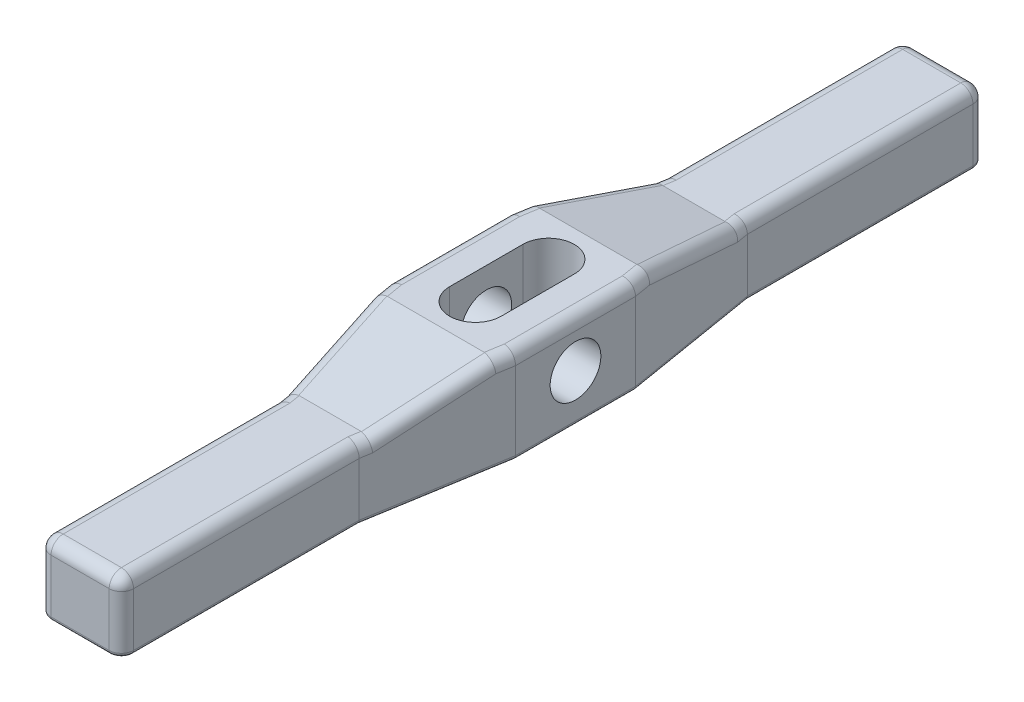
ISO-10303-21;
HEADER;
FILE_DESCRIPTION(('STEP AP214'),'2;1');
FILE_NAME('part.step','',(''),(''),'','','');
FILE_SCHEMA(('AUTOMOTIVE_DESIGN { 1 0 10303 214 1 1 1 1 }'));
ENDSEC;
DATA;
#1=APPLICATION_CONTEXT('core data for automotive mechanical design processes');
#2=APPLICATION_PROTOCOL_DEFINITION('international standard','automotive_design',2000,#1);
#3=PRODUCT_CONTEXT('',#1,'mechanical');
#4=PRODUCT('Part','Part','',(#3));
#5=PRODUCT_RELATED_PRODUCT_CATEGORY('part','',(#4));
#6=PRODUCT_DEFINITION_FORMATION('','',#4);
#7=PRODUCT_DEFINITION_CONTEXT('part definition',#1,'design');
#8=PRODUCT_DEFINITION('design','',#6,#7);
#9=PRODUCT_DEFINITION_SHAPE('','',#8);
#10=(LENGTH_UNIT() NAMED_UNIT(*) SI_UNIT(.MILLI.,.METRE.));
#11=(NAMED_UNIT(*) PLANE_ANGLE_UNIT() SI_UNIT($,.RADIAN.));
#12=(NAMED_UNIT(*) SI_UNIT($,.STERADIAN.) SOLID_ANGLE_UNIT());
#13=UNCERTAINTY_MEASURE_WITH_UNIT(LENGTH_MEASURE(1.E-05),#10,'distance_accuracy_value','');
#14=(GEOMETRIC_REPRESENTATION_CONTEXT(3) GLOBAL_UNCERTAINTY_ASSIGNED_CONTEXT((#13)) GLOBAL_UNIT_ASSIGNED_CONTEXT((#10,
#11,#12)) REPRESENTATION_CONTEXT('',''));
#15=CARTESIAN_POINT('',(0.,0.,0.));
#16=DIRECTION('',(0.,0.,1.));
#17=DIRECTION('',(1.,0.,0.));
#18=AXIS2_PLACEMENT_3D('',#15,#16,#17);
#19=CARTESIAN_POINT('',(5.1562,11.7602,53.975));
#20=DIRECTION('',(0.,1.,0.));
#21=DIRECTION('',(0.,0.,1.));
#22=AXIS2_PLACEMENT_3D('',#19,#20,#21);
#23=PLANE('',#22);
#24=DIRECTION('',(1.,0.,0.));
#25=VECTOR('',#24,1.);
#26=CARTESIAN_POINT('',(-7.9375,11.7602,-9.525));
#27=LINE('',#26,#25);
#28=CARTESIAN_POINT('',(-6.05605022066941,11.7602,-9.525));
#29=VERTEX_POINT('',#28);
#30=CARTESIAN_POINT('',(6.05605022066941,11.7602,-9.525));
#31=VERTEX_POINT('',#30);
#32=EDGE_CURVE('E895',#29,#31,#27,.T.);
#33=ORIENTED_EDGE('',*,*,#32,.F.);
#34=DIRECTION('',(-0.163705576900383,0.,0.986509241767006));
#35=VECTOR('',#34,1.);
#36=CARTESIAN_POINT('',(-6.43405991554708,11.7602,-7.24706870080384));
#37=LINE('',#36,#35);
#38=CARTESIAN_POINT('',(-6.4135,11.7602,-7.37096519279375));
#39=VERTEX_POINT('',#38);
#40=EDGE_CURVE('E597',#29,#39,#37,.T.);
#41=ORIENTED_EDGE('',*,*,#40,.T.);
#42=DIRECTION('',(0.,0.,1.));
#43=VECTOR('',#42,1.);
#44=CARTESIAN_POINT('',(-6.4135,11.7602,7.496556));
#45=LINE('',#44,#43);
#46=CARTESIAN_POINT('',(-6.4135,11.7602,7.37096519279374));
#47=VERTEX_POINT('',#46);
#48=EDGE_CURVE('E593',#39,#47,#45,.T.);
#49=ORIENTED_EDGE('',*,*,#48,.T.);
#50=DIRECTION('',(0.163705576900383,0.,0.986509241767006));
#51=VECTOR('',#50,1.);
#52=CARTESIAN_POINT('',(-6.09745121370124,11.7602,9.2755127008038));
#53=LINE('',#52,#51);
#54=CARTESIAN_POINT('',(-6.05605022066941,11.7602,9.525));
#55=VERTEX_POINT('',#54);
#56=EDGE_CURVE('E595',#47,#55,#53,.T.);
#57=ORIENTED_EDGE('',*,*,#56,.T.);
#58=DIRECTION('',(1.,0.,0.));
#59=VECTOR('',#58,1.);
#60=CARTESIAN_POINT('',(-7.9375,11.7602,9.525));
#61=LINE('',#60,#59);
#62=CARTESIAN_POINT('',(6.05605022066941,11.7602,9.525));
#63=VERTEX_POINT('',#62);
#64=EDGE_CURVE('E898',#55,#63,#61,.T.);
#65=ORIENTED_EDGE('',*,*,#64,.T.);
#66=DIRECTION('',(0.163705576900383,0.,-0.986509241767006));
#67=VECTOR('',#66,1.);
#68=CARTESIAN_POINT('',(6.43405991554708,11.7602,7.24706870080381));
#69=LINE('',#68,#67);
#70=CARTESIAN_POINT('',(6.4135,11.7602,7.37096519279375));
#71=VERTEX_POINT('',#70);
#72=EDGE_CURVE('E591',#63,#71,#69,.T.);
#73=ORIENTED_EDGE('',*,*,#72,.T.);
#74=DIRECTION('',(0.,0.,-1.));
#75=VECTOR('',#74,1.);
#76=CARTESIAN_POINT('',(6.4135,11.7602,-7.496556));
#77=LINE('',#76,#75);
#78=CARTESIAN_POINT('',(6.4135,11.7602,-7.37096519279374));
#79=VERTEX_POINT('',#78);
#80=EDGE_CURVE('E589',#71,#79,#77,.T.);
#81=ORIENTED_EDGE('',*,*,#80,.T.);
#82=DIRECTION('',(-0.163705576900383,0.,-0.986509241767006));
#83=VECTOR('',#82,1.);
#84=CARTESIAN_POINT('',(6.09745121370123,11.7602,-9.27551270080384));
#85=LINE('',#84,#83);
#86=EDGE_CURVE('E587',#79,#31,#85,.T.);
#87=ORIENTED_EDGE('',*,*,#86,.T.);
#88=EDGE_LOOP('',(#33,#41,#49,#57,#65,#73,#81,#87));
#89=FACE_BOUND('',#88,.T.);
#90=DIRECTION('',(0.,0.,1.));
#91=VECTOR('',#90,1.);
#92=CARTESIAN_POINT('',(-3.2131,11.7602,-4.572));
#93=LINE('',#92,#91);
#94=CARTESIAN_POINT('',(-3.2131,11.7602,-4.572));
#95=VERTEX_POINT('',#94);
#96=CARTESIAN_POINT('',(-3.2131,11.7602,4.572));
#97=VERTEX_POINT('',#96);
#98=EDGE_CURVE('E340',#95,#97,#93,.T.);
#99=ORIENTED_EDGE('',*,*,#98,.F.);
#100=CARTESIAN_POINT('',(0.,11.7602,-4.572));
#101=DIRECTION('',(0.,1.,0.));
#102=DIRECTION('',(0.,0.,1.));
#103=AXIS2_PLACEMENT_3D('',#100,#101,#102);
#104=CIRCLE('',#103,3.2131);
#105=CARTESIAN_POINT('',(3.2131,11.7602,-4.572));
#106=VERTEX_POINT('',#105);
#107=EDGE_CURVE('E330',#106,#95,#104,.T.);
#108=ORIENTED_EDGE('',*,*,#107,.F.);
#109=DIRECTION('',(0.,0.,-1.));
#110=VECTOR('',#109,1.);
#111=CARTESIAN_POINT('',(3.2131,11.7602,-4.572));
#112=LINE('',#111,#110);
#113=CARTESIAN_POINT('',(3.2131,11.7602,4.572));
#114=VERTEX_POINT('',#113);
#115=EDGE_CURVE('E355',#114,#106,#112,.T.);
#116=ORIENTED_EDGE('',*,*,#115,.F.);
#117=CARTESIAN_POINT('',(0.,11.7602,4.572));
#118=DIRECTION('',(0.,1.,0.));
#119=DIRECTION('',(0.,0.,1.));
#120=AXIS2_PLACEMENT_3D('',#117,#118,#119);
#121=CIRCLE('',#120,3.2131);
#122=EDGE_CURVE('E353',#97,#114,#121,.T.);
#123=ORIENTED_EDGE('',*,*,#122,.F.);
#124=EDGE_LOOP('',(#99,#108,#116,#123));
#125=FACE_BOUND('',#124,.T.);
#126=ADVANCED_FACE('F34',(#89,#125),#23,.T.);
#127=CARTESIAN_POINT('',(5.1562,0.,53.975));
#128=DIRECTION('',(0.,1.,0.));
#129=DIRECTION('',(0.,0.,1.));
#130=AXIS2_PLACEMENT_3D('',#127,#128,#129);
#131=PLANE('',#130);
#132=DIRECTION('',(0.,0.,1.));
#133=VECTOR('',#132,1.);
#134=CARTESIAN_POINT('',(-7.4295,0.,53.975));
#135=LINE('',#134,#133);
#136=CARTESIAN_POINT('',(-7.4295,0.,7.45469239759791));
#137=VERTEX_POINT('',#136);
#138=CARTESIAN_POINT('',(-7.4295,0.,-7.45469239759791));
#139=VERTEX_POINT('',#138);
#140=EDGE_CURVE('E445',#137,#139,#135,.F.);
#141=ORIENTED_EDGE('',*,*,#140,.T.);
#142=DIRECTION('',(-0.163705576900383,0.,0.986509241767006));
#143=VECTOR('',#142,1.);
#144=CARTESIAN_POINT('',(-17.0129243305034,0.,50.2961603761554));
#145=LINE('',#144,#143);
#146=CARTESIAN_POINT('',(-4.6482,0.,-24.2151363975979));
#147=VERTEX_POINT('',#146);
#148=EDGE_CURVE('E447',#139,#147,#145,.F.);
#149=ORIENTED_EDGE('',*,*,#148,.T.);
#150=DIRECTION('',(0.,0.,1.));
#151=VECTOR('',#150,1.);
#152=CARTESIAN_POINT('',(-4.6482,0.,53.975));
#153=LINE('',#152,#151);
#154=CARTESIAN_POINT('',(-4.6482,0.,-52.451));
#155=VERTEX_POINT('',#154);
#156=EDGE_CURVE('E432',#147,#155,#153,.F.);
#157=ORIENTED_EDGE('',*,*,#156,.T.);
#158=CARTESIAN_POINT('',(-3.6322,0.,-52.451));
#159=DIRECTION('',(0.,1.,0.));
#160=DIRECTION('',(0.,0.,1.));
#161=AXIS2_PLACEMENT_3D('',#158,#159,#160);
#162=CIRCLE('',#161,1.016);
#163=CARTESIAN_POINT('',(-3.6322,0.,-53.467));
#164=VERTEX_POINT('',#163);
#165=EDGE_CURVE('E430',#155,#164,#162,.F.);
#166=ORIENTED_EDGE('',*,*,#165,.T.);
#167=DIRECTION('',(-1.,0.,0.));
#168=VECTOR('',#167,1.);
#169=CARTESIAN_POINT('',(5.1562,0.,-53.467));
#170=LINE('',#169,#168);
#171=CARTESIAN_POINT('',(3.6322,0.,-53.467));
#172=VERTEX_POINT('',#171);
#173=EDGE_CURVE('E428',#164,#172,#170,.F.);
#174=ORIENTED_EDGE('',*,*,#173,.T.);
#175=CARTESIAN_POINT('',(3.6322,0.,-52.451));
#176=DIRECTION('',(0.,1.,0.));
#177=DIRECTION('',(0.,0.,1.));
#178=AXIS2_PLACEMENT_3D('',#175,#176,#177);
#179=CIRCLE('',#178,1.016);
#180=CARTESIAN_POINT('',(4.6482,0.,-52.451));
#181=VERTEX_POINT('',#180);
#182=EDGE_CURVE('E426',#172,#181,#179,.F.);
#183=ORIENTED_EDGE('',*,*,#182,.T.);
#184=DIRECTION('',(0.,0.,-1.));
#185=VECTOR('',#184,1.);
#186=CARTESIAN_POINT('',(4.6482,0.,53.975));
#187=LINE('',#186,#185);
#188=CARTESIAN_POINT('',(4.6482,0.,-24.2151363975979));
#189=VERTEX_POINT('',#188);
#190=EDGE_CURVE('E416',#181,#189,#187,.F.);
#191=ORIENTED_EDGE('',*,*,#190,.T.);
#192=DIRECTION('',(-0.163705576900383,0.,-0.986509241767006));
#193=VECTOR('',#192,1.);
#194=CARTESIAN_POINT('',(17.289291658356,0.,51.9615827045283));
#195=LINE('',#194,#193);
#196=CARTESIAN_POINT('',(7.4295,0.,-7.45469239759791));
#197=VERTEX_POINT('',#196);
#198=EDGE_CURVE('E418',#189,#197,#195,.F.);
#199=ORIENTED_EDGE('',*,*,#198,.T.);
#200=DIRECTION('',(0.,0.,-1.));
#201=VECTOR('',#200,1.);
#202=CARTESIAN_POINT('',(7.4295,0.,53.975));
#203=LINE('',#202,#201);
#204=CARTESIAN_POINT('',(7.4295,0.,7.45469239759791));
#205=VERTEX_POINT('',#204);
#206=EDGE_CURVE('E420',#197,#205,#203,.F.);
#207=ORIENTED_EDGE('',*,*,#206,.T.);
#208=DIRECTION('',(0.163705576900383,0.,-0.986509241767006));
#209=VECTOR('',#208,1.);
#210=CARTESIAN_POINT('',(-0.14431645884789,0.,53.0954095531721));
#211=LINE('',#210,#209);
#212=CARTESIAN_POINT('',(4.6482,0.,24.2151363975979));
#213=VERTEX_POINT('',#212);
#214=EDGE_CURVE('E422',#205,#213,#211,.F.);
#215=ORIENTED_EDGE('',*,*,#214,.T.);
#216=DIRECTION('',(0.,0.,-1.));
#217=VECTOR('',#216,1.);
#218=CARTESIAN_POINT('',(4.6482,0.,53.975));
#219=LINE('',#218,#217);
#220=CARTESIAN_POINT('',(4.6482,0.,52.451));
#221=VERTEX_POINT('',#220);
#222=EDGE_CURVE('E424',#213,#221,#219,.F.);
#223=ORIENTED_EDGE('',*,*,#222,.T.);
#224=CARTESIAN_POINT('',(3.6322,0.,52.451));
#225=DIRECTION('',(0.,1.,0.));
#226=DIRECTION('',(0.,0.,1.));
#227=AXIS2_PLACEMENT_3D('',#224,#225,#226);
#228=CIRCLE('',#227,1.016);
#229=CARTESIAN_POINT('',(3.6322,0.,53.467));
#230=VERTEX_POINT('',#229);
#231=EDGE_CURVE('E434',#221,#230,#228,.F.);
#232=ORIENTED_EDGE('',*,*,#231,.T.);
#233=DIRECTION('',(1.,0.,0.));
#234=VECTOR('',#233,1.);
#235=CARTESIAN_POINT('',(5.1562,0.,53.467));
#236=LINE('',#235,#234);
#237=CARTESIAN_POINT('',(-3.6322,0.,53.467));
#238=VERTEX_POINT('',#237);
#239=EDGE_CURVE('E436',#230,#238,#236,.F.);
#240=ORIENTED_EDGE('',*,*,#239,.T.);
#241=CARTESIAN_POINT('',(-3.6322,0.,52.451));
#242=DIRECTION('',(0.,1.,0.));
#243=DIRECTION('',(0.,0.,1.));
#244=AXIS2_PLACEMENT_3D('',#241,#242,#243);
#245=CIRCLE('',#244,1.016);
#246=CARTESIAN_POINT('',(-4.6482,0.,52.451));
#247=VERTEX_POINT('',#246);
#248=EDGE_CURVE('E438',#238,#247,#245,.F.);
#249=ORIENTED_EDGE('',*,*,#248,.T.);
#250=DIRECTION('',(0.,0.,1.));
#251=VECTOR('',#250,1.);
#252=CARTESIAN_POINT('',(-4.6482,0.,53.975));
#253=LINE('',#252,#251);
#254=CARTESIAN_POINT('',(-4.6482,0.,24.2151363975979));
#255=VERTEX_POINT('',#254);
#256=EDGE_CURVE('E440',#247,#255,#253,.F.);
#257=ORIENTED_EDGE('',*,*,#256,.T.);
#258=DIRECTION('',(0.163705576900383,0.,0.986509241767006));
#259=VECTOR('',#258,1.);
#260=CARTESIAN_POINT('',(0.420683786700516,0.,54.760831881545));
#261=LINE('',#260,#259);
#262=EDGE_CURVE('E443',#255,#137,#261,.F.);
#263=ORIENTED_EDGE('',*,*,#262,.T.);
#264=EDGE_LOOP('',(#141,#149,#157,#166,#174,#183,#191,#199,#207,#215,#223,#232,#240,#249,#257,#263));
#265=FACE_BOUND('',#264,.T.);
#266=CARTESIAN_POINT('',(0.,0.,-4.572));
#267=DIRECTION('',(0.,1.,0.));
#268=DIRECTION('',(0.,0.,1.));
#269=AXIS2_PLACEMENT_3D('',#266,#267,#268);
#270=CIRCLE('',#269,3.2131);
#271=CARTESIAN_POINT('',(3.2131,0.,-4.572));
#272=VERTEX_POINT('',#271);
#273=CARTESIAN_POINT('',(-3.2131,0.,-4.572));
#274=VERTEX_POINT('',#273);
#275=EDGE_CURVE('E360',#272,#274,#270,.T.);
#276=ORIENTED_EDGE('',*,*,#275,.T.);
#277=DIRECTION('',(0.,0.,1.));
#278=VECTOR('',#277,1.);
#279=CARTESIAN_POINT('',(-3.2131,0.,-4.572));
#280=LINE('',#279,#278);
#281=CARTESIAN_POINT('',(-3.2131,0.,4.572));
#282=VERTEX_POINT('',#281);
#283=EDGE_CURVE('E347',#274,#282,#280,.T.);
#284=ORIENTED_EDGE('',*,*,#283,.T.);
#285=CARTESIAN_POINT('',(0.,0.,4.572));
#286=DIRECTION('',(0.,1.,0.));
#287=DIRECTION('',(0.,0.,1.));
#288=AXIS2_PLACEMENT_3D('',#285,#286,#287);
#289=CIRCLE('',#288,3.2131);
#290=CARTESIAN_POINT('',(3.2131,0.,4.572));
#291=VERTEX_POINT('',#290);
#292=EDGE_CURVE('E364',#282,#291,#289,.T.);
#293=ORIENTED_EDGE('',*,*,#292,.T.);
#294=DIRECTION('',(0.,0.,-1.));
#295=VECTOR('',#294,1.);
#296=CARTESIAN_POINT('',(3.2131,0.,-4.572));
#297=LINE('',#296,#295);
#298=EDGE_CURVE('E341',#291,#272,#297,.T.);
#299=ORIENTED_EDGE('',*,*,#298,.T.);
#300=EDGE_LOOP('',(#276,#284,#293,#299));
#301=FACE_BOUND('',#300,.T.);
#302=ADVANCED_FACE('F738',(#265,#301),#131,.F.);
#303=CARTESIAN_POINT('',(5.1562,11.7602,-53.975));
#304=DIRECTION('',(-1.,0.,0.));
#305=DIRECTION('',(0.,0.,1.));
#306=AXIS2_PLACEMENT_3D('',#303,#304,#305);
#307=PLANE('',#306);
#308=DIRECTION('',(0.,-1.,0.));
#309=VECTOR('',#308,1.);
#310=CARTESIAN_POINT('',(5.1562,11.7602,-52.451));
#311=LINE('',#310,#309);
#312=CARTESIAN_POINT('',(5.1562,0.508,-52.451));
#313=VERTEX_POINT('',#312);
#314=CARTESIAN_POINT('',(5.1562,7.1882,-52.451));
#315=VERTEX_POINT('',#314);
#316=EDGE_CURVE('E400',#313,#315,#311,.F.);
#317=ORIENTED_EDGE('',*,*,#316,.T.);
#318=DIRECTION('',(0.,0.,1.));
#319=VECTOR('',#318,1.);
#320=CARTESIAN_POINT('',(5.1562,7.1882,-53.975));
#321=LINE('',#320,#319);
#322=CARTESIAN_POINT('',(5.1562,7.1882,-24.257));
#323=VERTEX_POINT('',#322);
#324=EDGE_CURVE('E632',#315,#323,#321,.T.);
#325=ORIENTED_EDGE('',*,*,#324,.T.);
#326=DIRECTION('',(0.,-1.,0.));
#327=VECTOR('',#326,1.);
#328=CARTESIAN_POINT('',(5.1562,11.7602,-24.257));
#329=LINE('',#328,#327);
#330=CARTESIAN_POINT('',(5.1562,0.508000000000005,-24.257));
#331=VERTEX_POINT('',#330);
#332=EDGE_CURVE('E348',#323,#331,#329,.T.);
#333=ORIENTED_EDGE('',*,*,#332,.T.);
#334=DIRECTION('',(0.,0.,-1.));
#335=VECTOR('',#334,1.);
#336=CARTESIAN_POINT('',(5.1562,0.508,-53.975));
#337=LINE('',#336,#335);
#338=EDGE_CURVE('E489',#331,#313,#337,.T.);
#339=ORIENTED_EDGE('',*,*,#338,.T.);
#340=EDGE_LOOP('',(#317,#325,#333,#339));
#341=FACE_BOUND('',#340,.T.);
#342=ADVANCED_FACE('F723',(#341),#307,.F.);
#343=CARTESIAN_POINT('',(-5.1562,11.7602,-53.975));
#344=DIRECTION('',(0.,0.,1.));
#345=DIRECTION('',(1.,0.,0.));
#346=AXIS2_PLACEMENT_3D('',#343,#344,#345);
#347=PLANE('',#346);
#348=DIRECTION('',(0.,-1.,0.));
#349=VECTOR('',#348,1.);
#350=CARTESIAN_POINT('',(-3.6322,11.7602,-53.975));
#351=LINE('',#350,#349);
#352=CARTESIAN_POINT('',(-3.6322,0.508,-53.975));
#353=VERTEX_POINT('',#352);
#354=CARTESIAN_POINT('',(-3.6322,7.1882,-53.975));
#355=VERTEX_POINT('',#354);
#356=EDGE_CURVE('E397',#353,#355,#351,.F.);
#357=ORIENTED_EDGE('',*,*,#356,.T.);
#358=DIRECTION('',(1.,0.,0.));
#359=VECTOR('',#358,1.);
#360=CARTESIAN_POINT('',(-5.1562,7.1882,-53.975));
#361=LINE('',#360,#359);
#362=CARTESIAN_POINT('',(3.6322,7.1882,-53.975));
#363=VERTEX_POINT('',#362);
#364=EDGE_CURVE('E570',#355,#363,#361,.T.);
#365=ORIENTED_EDGE('',*,*,#364,.T.);
#366=DIRECTION('',(0.,-1.,0.));
#367=VECTOR('',#366,1.);
#368=CARTESIAN_POINT('',(3.6322,11.7602,-53.975));
#369=LINE('',#368,#367);
#370=CARTESIAN_POINT('',(3.6322,0.508,-53.975));
#371=VERTEX_POINT('',#370);
#372=EDGE_CURVE('E395',#363,#371,#369,.T.);
#373=ORIENTED_EDGE('',*,*,#372,.T.);
#374=DIRECTION('',(-1.,0.,0.));
#375=VECTOR('',#374,1.);
#376=CARTESIAN_POINT('',(-5.1562,0.508,-53.975));
#377=LINE('',#376,#375);
#378=EDGE_CURVE('E463',#371,#353,#377,.T.);
#379=ORIENTED_EDGE('',*,*,#378,.T.);
#380=EDGE_LOOP('',(#357,#365,#373,#379));
#381=FACE_BOUND('',#380,.T.);
#382=ADVANCED_FACE('F753',(#381),#347,.F.);
#383=CARTESIAN_POINT('',(-5.1562,11.7602,-53.975));
#384=DIRECTION('',(1.,0.,0.));
#385=DIRECTION('',(0.,0.,-1.));
#386=AXIS2_PLACEMENT_3D('',#383,#384,#385);
#387=PLANE('',#386);
#388=DIRECTION('',(0.,-1.,0.));
#389=VECTOR('',#388,1.);
#390=CARTESIAN_POINT('',(-5.1562,11.7602,-24.257));
#391=LINE('',#390,#389);
#392=CARTESIAN_POINT('',(-5.1562,7.1882,-24.257));
#393=VERTEX_POINT('',#392);
#394=CARTESIAN_POINT('',(-5.1562,0.508000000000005,-24.257));
#395=VERTEX_POINT('',#394);
#396=EDGE_CURVE('E386',#393,#395,#391,.T.);
#397=ORIENTED_EDGE('',*,*,#396,.F.);
#398=DIRECTION('',(0.,0.,-1.));
#399=VECTOR('',#398,1.);
#400=CARTESIAN_POINT('',(-5.1562,7.1882,-53.975));
#401=LINE('',#400,#399);
#402=CARTESIAN_POINT('',(-5.1562,7.1882,-52.451));
#403=VERTEX_POINT('',#402);
#404=EDGE_CURVE('E556',#393,#403,#401,.T.);
#405=ORIENTED_EDGE('',*,*,#404,.T.);
#406=DIRECTION('',(0.,-1.,0.));
#407=VECTOR('',#406,1.);
#408=CARTESIAN_POINT('',(-5.1562,11.7602,-52.451));
#409=LINE('',#408,#407);
#410=CARTESIAN_POINT('',(-5.1562,0.508,-52.451));
#411=VERTEX_POINT('',#410);
#412=EDGE_CURVE('E388',#403,#411,#409,.T.);
#413=ORIENTED_EDGE('',*,*,#412,.T.);
#414=DIRECTION('',(0.,0.,1.));
#415=VECTOR('',#414,1.);
#416=CARTESIAN_POINT('',(-5.1562,0.508,-53.975));
#417=LINE('',#416,#415);
#418=EDGE_CURVE('E457',#411,#395,#417,.T.);
#419=ORIENTED_EDGE('',*,*,#418,.T.);
#420=EDGE_LOOP('',(#397,#405,#413,#419));
#421=FACE_BOUND('',#420,.T.);
#422=ADVANCED_FACE('F962',(#421),#387,.F.);
#423=CARTESIAN_POINT('',(-5.1562,11.7602,-24.257));
#424=DIRECTION('',(0.986509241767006,0.,0.163705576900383));
#425=DIRECTION('',(0.163705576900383,0.,-0.986509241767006));
#426=AXIS2_PLACEMENT_3D('',#423,#424,#425);
#427=PLANE('',#426);
#428=DIRECTION('',(0.159618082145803,-0.222066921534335,-0.961877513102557));
#429=VECTOR('',#428,1.);
#430=CARTESIAN_POINT('',(-5.33015566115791,7.09457495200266,-23.2087225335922));
#431=LINE('',#430,#429);
#432=CARTESIAN_POINT('',(-7.58830451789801,10.2362,-9.60084943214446));
#433=VERTEX_POINT('',#432);
#434=CARTESIAN_POINT('',(-5.39745181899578,7.1882,-22.803187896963));
#435=VERTEX_POINT('',#434);
#436=EDGE_CURVE('E576',#433,#435,#431,.T.);
#437=ORIENTED_EDGE('',*,*,#436,.T.);
#438=DIRECTION('',(0.163705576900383,0.,-0.986509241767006));
#439=VECTOR('',#438,1.);
#440=CARTESIAN_POINT('',(-5.1562,7.1882,-24.257));
#441=LINE('',#440,#439);
#442=EDGE_CURVE('E578',#435,#393,#441,.T.);
#443=ORIENTED_EDGE('',*,*,#442,.T.);
#444=ORIENTED_EDGE('',*,*,#396,.T.);
#445=DIRECTION('',(-0.163705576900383,0.,0.986509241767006));
#446=VECTOR('',#445,1.);
#447=CARTESIAN_POINT('',(-5.1562,0.508,-24.257));
#448=LINE('',#447,#446);
#449=CARTESIAN_POINT('',(-7.9375,0.508000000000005,-7.496556));
#450=VERTEX_POINT('',#449);
#451=EDGE_CURVE('E468',#395,#450,#448,.T.);
#452=ORIENTED_EDGE('',*,*,#451,.T.);
#453=DIRECTION('',(0.,-1.,0.));
#454=VECTOR('',#453,1.);
#455=CARTESIAN_POINT('',(-7.9375,11.7602,-7.496556));
#456=LINE('',#455,#454);
#457=CARTESIAN_POINT('',(-7.9375,10.2362,-7.496556));
#458=VERTEX_POINT('',#457);
#459=EDGE_CURVE('E384',#458,#450,#456,.T.);
#460=ORIENTED_EDGE('',*,*,#459,.F.);
#461=DIRECTION('',(-0.163705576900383,0.,0.986509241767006));
#462=VECTOR('',#461,1.);
#463=CARTESIAN_POINT('',(-7.60089129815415,10.2362,-9.52500000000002));
#464=LINE('',#463,#462);
#465=EDGE_CURVE('E574',#458,#433,#464,.F.);
#466=ORIENTED_EDGE('',*,*,#465,.T.);
#467=EDGE_LOOP('',(#437,#443,#444,#452,#460,#466));
#468=FACE_BOUND('',#467,.T.);
#469=ADVANCED_FACE('F877',(#468),#427,.F.);
#470=CARTESIAN_POINT('',(-7.9375,11.7602,-7.496556));
#471=DIRECTION('',(1.,0.,0.));
#472=DIRECTION('',(0.,0.,-1.));
#473=AXIS2_PLACEMENT_3D('',#470,#471,#472);
#474=PLANE('',#473);
#475=CARTESIAN_POINT('',(-7.9375,5.9436,0.));
#476=DIRECTION('',(1.,0.,0.));
#477=DIRECTION('',(0.,0.,-1.));
#478=AXIS2_PLACEMENT_3D('',#475,#476,#477);
#479=CIRCLE('',#478,3.16865);
#480=CARTESIAN_POINT('',(-7.9375,5.9436,-3.16865));
#481=VERTEX_POINT('',#480);
#482=EDGE_CURVE('E393',#481,#481,#479,.T.);
#483=ORIENTED_EDGE('',*,*,#482,.T.);
#484=EDGE_LOOP('',(#483));
#485=FACE_BOUND('',#484,.T.);
#486=DIRECTION('',(0.,-1.,0.));
#487=VECTOR('',#486,1.);
#488=CARTESIAN_POINT('',(-7.9375,11.7602,7.496556));
#489=LINE('',#488,#487);
#490=CARTESIAN_POINT('',(-7.9375,10.2362,7.496556));
#491=VERTEX_POINT('',#490);
#492=CARTESIAN_POINT('',(-7.9375,0.508000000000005,7.496556));
#493=VERTEX_POINT('',#492);
#494=EDGE_CURVE('E382',#491,#493,#489,.T.);
#495=ORIENTED_EDGE('',*,*,#494,.F.);
#496=DIRECTION('',(0.,0.,1.));
#497=VECTOR('',#496,1.);
#498=CARTESIAN_POINT('',(-7.9375,10.2362,-7.496556));
#499=LINE('',#498,#497);
#500=EDGE_CURVE('E612',#491,#458,#499,.F.);
#501=ORIENTED_EDGE('',*,*,#500,.T.);
#502=ORIENTED_EDGE('',*,*,#459,.T.);
#503=DIRECTION('',(0.,0.,1.));
#504=VECTOR('',#503,1.);
#505=CARTESIAN_POINT('',(-7.9375,0.508,-7.496556));
#506=LINE('',#505,#504);
#507=EDGE_CURVE('E471',#450,#493,#506,.T.);
#508=ORIENTED_EDGE('',*,*,#507,.T.);
#509=EDGE_LOOP('',(#495,#501,#502,#508));
#510=FACE_BOUND('',#509,.T.);
#511=ADVANCED_FACE('F874',(#485,#510),#474,.F.);
#512=CARTESIAN_POINT('',(-5.1562,11.7602,24.257));
#513=DIRECTION('',(0.986509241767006,0.,-0.163705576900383));
#514=DIRECTION('',(-0.163705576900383,0.,-0.986509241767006));
#515=AXIS2_PLACEMENT_3D('',#512,#513,#514);
#516=PLANE('',#515);
#517=DIRECTION('',(-0.159618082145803,0.222066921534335,-0.961877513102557));
#518=VECTOR('',#517,1.);
#519=CARTESIAN_POINT('',(-5.33015566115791,7.09457495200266,23.2087225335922));
#520=LINE('',#519,#518);
#521=CARTESIAN_POINT('',(-5.39745181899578,7.1882,22.803187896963));
#522=VERTEX_POINT('',#521);
#523=CARTESIAN_POINT('',(-7.58830451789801,10.2362,9.60084943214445));
#524=VERTEX_POINT('',#523);
#525=EDGE_CURVE('E608',#522,#524,#520,.T.);
#526=ORIENTED_EDGE('',*,*,#525,.T.);
#527=DIRECTION('',(0.163705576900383,0.,0.986509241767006));
#528=VECTOR('',#527,1.);
#529=CARTESIAN_POINT('',(-7.9375,10.2362,7.49655599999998));
#530=LINE('',#529,#528);
#531=EDGE_CURVE('E610',#524,#491,#530,.F.);
#532=ORIENTED_EDGE('',*,*,#531,.T.);
#533=ORIENTED_EDGE('',*,*,#494,.T.);
#534=DIRECTION('',(0.163705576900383,0.,0.986509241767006));
#535=VECTOR('',#534,1.);
#536=CARTESIAN_POINT('',(-5.1562,0.508,24.257));
#537=LINE('',#536,#535);
#538=CARTESIAN_POINT('',(-5.1562,0.508000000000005,24.257));
#539=VERTEX_POINT('',#538);
#540=EDGE_CURVE('E474',#493,#539,#537,.T.);
#541=ORIENTED_EDGE('',*,*,#540,.T.);
#542=DIRECTION('',(0.,-1.,0.));
#543=VECTOR('',#542,1.);
#544=CARTESIAN_POINT('',(-5.1562,11.7602,24.257));
#545=LINE('',#544,#543);
#546=CARTESIAN_POINT('',(-5.1562,7.1882,24.257));
#547=VERTEX_POINT('',#546);
#548=EDGE_CURVE('E380',#547,#539,#545,.T.);
#549=ORIENTED_EDGE('',*,*,#548,.F.);
#550=DIRECTION('',(-0.163705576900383,0.,-0.986509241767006));
#551=VECTOR('',#550,1.);
#552=CARTESIAN_POINT('',(-5.1562,7.1882,24.257));
#553=LINE('',#552,#551);
#554=EDGE_CURVE('E606',#547,#522,#553,.T.);
#555=ORIENTED_EDGE('',*,*,#554,.T.);
#556=EDGE_LOOP('',(#526,#532,#533,#541,#549,#555));
#557=FACE_BOUND('',#556,.T.);
#558=ADVANCED_FACE('F848',(#557),#516,.F.);
#559=CARTESIAN_POINT('',(-5.1562,11.7602,53.975));
#560=DIRECTION('',(1.,0.,0.));
#561=DIRECTION('',(0.,0.,-1.));
#562=AXIS2_PLACEMENT_3D('',#559,#560,#561);
#563=PLANE('',#562);
#564=DIRECTION('',(0.,-1.,0.));
#565=VECTOR('',#564,1.);
#566=CARTESIAN_POINT('',(-5.1562,11.7602,52.451));
#567=LINE('',#566,#565);
#568=CARTESIAN_POINT('',(-5.1562,0.508,52.451));
#569=VERTEX_POINT('',#568);
#570=CARTESIAN_POINT('',(-5.1562,7.1882,52.451));
#571=VERTEX_POINT('',#570);
#572=EDGE_CURVE('E410',#569,#571,#567,.F.);
#573=ORIENTED_EDGE('',*,*,#572,.T.);
#574=DIRECTION('',(0.,0.,-1.));
#575=VECTOR('',#574,1.);
#576=CARTESIAN_POINT('',(-5.1562,7.1882,53.975));
#577=LINE('',#576,#575);
#578=EDGE_CURVE('E614',#571,#547,#577,.T.);
#579=ORIENTED_EDGE('',*,*,#578,.T.);
#580=ORIENTED_EDGE('',*,*,#548,.T.);
#581=DIRECTION('',(0.,0.,1.));
#582=VECTOR('',#581,1.);
#583=CARTESIAN_POINT('',(-5.1562,0.508,53.975));
#584=LINE('',#583,#582);
#585=EDGE_CURVE('E413',#539,#569,#584,.T.);
#586=ORIENTED_EDGE('',*,*,#585,.T.);
#587=EDGE_LOOP('',(#573,#579,#580,#586));
#588=FACE_BOUND('',#587,.T.);
#589=ADVANCED_FACE('F827',(#588),#563,.F.);
#590=CARTESIAN_POINT('',(-5.1562,11.7602,53.975));
#591=DIRECTION('',(0.,0.,-1.));
#592=DIRECTION('',(-1.,0.,0.));
#593=AXIS2_PLACEMENT_3D('',#590,#591,#592);
#594=PLANE('',#593);
#595=DIRECTION('',(0.,-1.,0.));
#596=VECTOR('',#595,1.);
#597=CARTESIAN_POINT('',(3.6322,11.7602,53.975));
#598=LINE('',#597,#596);
#599=CARTESIAN_POINT('',(3.6322,0.508,53.975));
#600=VERTEX_POINT('',#599);
#601=CARTESIAN_POINT('',(3.6322,7.1882,53.975));
#602=VERTEX_POINT('',#601);
#603=EDGE_CURVE('E407',#600,#602,#598,.F.);
#604=ORIENTED_EDGE('',*,*,#603,.T.);
#605=DIRECTION('',(1.,0.,0.));
#606=VECTOR('',#605,1.);
#607=CARTESIAN_POINT('',(-5.1562,7.1882,53.975));
#608=LINE('',#607,#606);
#609=CARTESIAN_POINT('',(-3.6322,7.1882,53.975));
#610=VERTEX_POINT('',#609);
#611=EDGE_CURVE('E552',#602,#610,#608,.F.);
#612=ORIENTED_EDGE('',*,*,#611,.T.);
#613=DIRECTION('',(0.,-1.,0.));
#614=VECTOR('',#613,1.);
#615=CARTESIAN_POINT('',(-3.6322,11.7602,53.975));
#616=LINE('',#615,#614);
#617=CARTESIAN_POINT('',(-3.6322,0.508,53.975));
#618=VERTEX_POINT('',#617);
#619=EDGE_CURVE('E405',#610,#618,#616,.T.);
#620=ORIENTED_EDGE('',*,*,#619,.T.);
#621=DIRECTION('',(1.,0.,0.));
#622=VECTOR('',#621,1.);
#623=CARTESIAN_POINT('',(-5.1562,0.508,53.975));
#624=LINE('',#623,#622);
#625=EDGE_CURVE('E452',#618,#600,#624,.T.);
#626=ORIENTED_EDGE('',*,*,#625,.T.);
#627=EDGE_LOOP('',(#604,#612,#620,#626));
#628=FACE_BOUND('',#627,.T.);
#629=ADVANCED_FACE('F949',(#628),#594,.F.);
#630=CARTESIAN_POINT('',(5.1562,11.7602,53.975));
#631=DIRECTION('',(-1.,0.,0.));
#632=DIRECTION('',(0.,0.,1.));
#633=AXIS2_PLACEMENT_3D('',#630,#631,#632);
#634=PLANE('',#633);
#635=DIRECTION('',(0.,-1.,0.));
#636=VECTOR('',#635,1.);
#637=CARTESIAN_POINT('',(5.1562,11.7602,24.257));
#638=LINE('',#637,#636);
#639=CARTESIAN_POINT('',(5.1562,7.1882,24.257));
#640=VERTEX_POINT('',#639);
#641=CARTESIAN_POINT('',(5.1562,0.508000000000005,24.257));
#642=VERTEX_POINT('',#641);
#643=EDGE_CURVE('E378',#640,#642,#638,.T.);
#644=ORIENTED_EDGE('',*,*,#643,.F.);
#645=DIRECTION('',(0.,0.,1.));
#646=VECTOR('',#645,1.);
#647=CARTESIAN_POINT('',(5.1562,7.1882,53.975));
#648=LINE('',#647,#646);
#649=CARTESIAN_POINT('',(5.1562,7.1882,52.451));
#650=VERTEX_POINT('',#649);
#651=EDGE_CURVE('E616',#640,#650,#648,.T.);
#652=ORIENTED_EDGE('',*,*,#651,.T.);
#653=DIRECTION('',(0.,-1.,0.));
#654=VECTOR('',#653,1.);
#655=CARTESIAN_POINT('',(5.1562,11.7602,52.451));
#656=LINE('',#655,#654);
#657=CARTESIAN_POINT('',(5.1562,0.508,52.451));
#658=VERTEX_POINT('',#657);
#659=EDGE_CURVE('E403',#650,#658,#656,.T.);
#660=ORIENTED_EDGE('',*,*,#659,.T.);
#661=DIRECTION('',(0.,0.,-1.));
#662=VECTOR('',#661,1.);
#663=CARTESIAN_POINT('',(5.1562,0.508,53.975));
#664=LINE('',#663,#662);
#665=EDGE_CURVE('E477',#658,#642,#664,.T.);
#666=ORIENTED_EDGE('',*,*,#665,.T.);
#667=EDGE_LOOP('',(#644,#652,#660,#666));
#668=FACE_BOUND('',#667,.T.);
#669=ADVANCED_FACE('F945',(#668),#634,.F.);
#670=CARTESIAN_POINT('',(5.1562,11.7602,24.257));
#671=DIRECTION('',(-0.986509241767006,0.,-0.163705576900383));
#672=DIRECTION('',(-0.163705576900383,0.,0.986509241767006));
#673=AXIS2_PLACEMENT_3D('',#670,#671,#672);
#674=PLANE('',#673);
#675=DIRECTION('',(-0.159618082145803,-0.222066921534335,0.961877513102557));
#676=VECTOR('',#675,1.);
#677=CARTESIAN_POINT('',(5.33015566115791,7.09457495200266,23.2087225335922));
#678=LINE('',#677,#676);
#679=CARTESIAN_POINT('',(7.58830451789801,10.2362,9.60084943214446));
#680=VERTEX_POINT('',#679);
#681=CARTESIAN_POINT('',(5.39745181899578,7.1882,22.803187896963));
#682=VERTEX_POINT('',#681);
#683=EDGE_CURVE('E620',#680,#682,#678,.T.);
#684=ORIENTED_EDGE('',*,*,#683,.T.);
#685=DIRECTION('',(-0.163705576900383,0.,0.986509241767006));
#686=VECTOR('',#685,1.);
#687=CARTESIAN_POINT('',(5.1562,7.1882,24.257));
#688=LINE('',#687,#686);
#689=EDGE_CURVE('E622',#682,#640,#688,.T.);
#690=ORIENTED_EDGE('',*,*,#689,.T.);
#691=ORIENTED_EDGE('',*,*,#643,.T.);
#692=DIRECTION('',(0.163705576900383,0.,-0.986509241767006));
#693=VECTOR('',#692,1.);
#694=CARTESIAN_POINT('',(5.1562,0.508,24.257));
#695=LINE('',#694,#693);
#696=CARTESIAN_POINT('',(7.9375,0.508000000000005,7.496556));
#697=VERTEX_POINT('',#696);
#698=EDGE_CURVE('E480',#642,#697,#695,.T.);
#699=ORIENTED_EDGE('',*,*,#698,.T.);
#700=DIRECTION('',(0.,-1.,0.));
#701=VECTOR('',#700,1.);
#702=CARTESIAN_POINT('',(7.9375,11.7602,7.496556));
#703=LINE('',#702,#701);
#704=CARTESIAN_POINT('',(7.9375,10.2362,7.496556));
#705=VERTEX_POINT('',#704);
#706=EDGE_CURVE('E376',#705,#697,#703,.T.);
#707=ORIENTED_EDGE('',*,*,#706,.F.);
#708=DIRECTION('',(0.163705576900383,0.,-0.986509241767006));
#709=VECTOR('',#708,1.);
#710=CARTESIAN_POINT('',(7.60089129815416,10.2362,9.52499999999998));
#711=LINE('',#710,#709);
#712=EDGE_CURVE('E618',#705,#680,#711,.F.);
#713=ORIENTED_EDGE('',*,*,#712,.T.);
#714=EDGE_LOOP('',(#684,#690,#691,#699,#707,#713));
#715=FACE_BOUND('',#714,.T.);
#716=ADVANCED_FACE('F941',(#715),#674,.F.);
#717=CARTESIAN_POINT('',(7.9375,11.7602,-7.496556));
#718=DIRECTION('',(-1.,0.,0.));
#719=DIRECTION('',(0.,0.,1.));
#720=AXIS2_PLACEMENT_3D('',#717,#718,#719);
#721=PLANE('',#720);
#722=CARTESIAN_POINT('',(7.9375,5.9436,0.));
#723=DIRECTION('',(1.,0.,0.));
#724=DIRECTION('',(0.,0.,-1.));
#725=AXIS2_PLACEMENT_3D('',#722,#723,#724);
#726=CIRCLE('',#725,3.16865);
#727=CARTESIAN_POINT('',(7.9375,5.9436,-3.16865));
#728=VERTEX_POINT('',#727);
#729=EDGE_CURVE('E538',#728,#728,#726,.T.);
#730=ORIENTED_EDGE('',*,*,#729,.F.);
#731=EDGE_LOOP('',(#730));
#732=FACE_BOUND('',#731,.T.);
#733=DIRECTION('',(0.,-1.,0.));
#734=VECTOR('',#733,1.);
#735=CARTESIAN_POINT('',(7.9375,11.7602,-7.496556));
#736=LINE('',#735,#734);
#737=CARTESIAN_POINT('',(7.9375,10.2362,-7.496556));
#738=VERTEX_POINT('',#737);
#739=CARTESIAN_POINT('',(7.9375,0.508000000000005,-7.496556));
#740=VERTEX_POINT('',#739);
#741=EDGE_CURVE('E374',#738,#740,#736,.T.);
#742=ORIENTED_EDGE('',*,*,#741,.F.);
#743=DIRECTION('',(0.,0.,-1.));
#744=VECTOR('',#743,1.);
#745=CARTESIAN_POINT('',(7.9375,10.2362,7.496556));
#746=LINE('',#745,#744);
#747=EDGE_CURVE('E624',#738,#705,#746,.F.);
#748=ORIENTED_EDGE('',*,*,#747,.T.);
#749=ORIENTED_EDGE('',*,*,#706,.T.);
#750=DIRECTION('',(0.,0.,-1.));
#751=VECTOR('',#750,1.);
#752=CARTESIAN_POINT('',(7.9375,0.508,-7.496556));
#753=LINE('',#752,#751);
#754=EDGE_CURVE('E483',#697,#740,#753,.T.);
#755=ORIENTED_EDGE('',*,*,#754,.T.);
#756=EDGE_LOOP('',(#742,#748,#749,#755));
#757=FACE_BOUND('',#756,.T.);
#758=ADVANCED_FACE('F788',(#732,#757),#721,.F.);
#759=CARTESIAN_POINT('',(5.1562,11.7602,-24.257));
#760=DIRECTION('',(-0.986509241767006,0.,0.163705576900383));
#761=DIRECTION('',(0.163705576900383,0.,0.986509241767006));
#762=AXIS2_PLACEMENT_3D('',#759,#760,#761);
#763=PLANE('',#762);
#764=DIRECTION('',(0.159618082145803,0.222066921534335,0.961877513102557));
#765=VECTOR('',#764,1.);
#766=CARTESIAN_POINT('',(5.33015566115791,7.09457495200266,-23.2087225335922));
#767=LINE('',#766,#765);
#768=CARTESIAN_POINT('',(5.39745181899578,7.1882,-22.803187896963));
#769=VERTEX_POINT('',#768);
#770=CARTESIAN_POINT('',(7.58830451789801,10.2362,-9.60084943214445));
#771=VERTEX_POINT('',#770);
#772=EDGE_CURVE('E626',#769,#771,#767,.T.);
#773=ORIENTED_EDGE('',*,*,#772,.T.);
#774=DIRECTION('',(-0.163705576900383,0.,-0.986509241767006));
#775=VECTOR('',#774,1.);
#776=CARTESIAN_POINT('',(7.9375,10.2362,-7.49655600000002));
#777=LINE('',#776,#775);
#778=EDGE_CURVE('E630',#771,#738,#777,.F.);
#779=ORIENTED_EDGE('',*,*,#778,.T.);
#780=ORIENTED_EDGE('',*,*,#741,.T.);
#781=DIRECTION('',(-0.163705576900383,0.,-0.986509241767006));
#782=VECTOR('',#781,1.);
#783=CARTESIAN_POINT('',(5.1562,0.508,-24.257));
#784=LINE('',#783,#782);
#785=EDGE_CURVE('E486',#740,#331,#784,.T.);
#786=ORIENTED_EDGE('',*,*,#785,.T.);
#787=ORIENTED_EDGE('',*,*,#332,.F.);
#788=DIRECTION('',(0.163705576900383,0.,0.986509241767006));
#789=VECTOR('',#788,1.);
#790=CARTESIAN_POINT('',(5.1562,7.1882,-24.257));
#791=LINE('',#790,#789);
#792=EDGE_CURVE('E628',#323,#769,#791,.T.);
#793=ORIENTED_EDGE('',*,*,#792,.T.);
#794=EDGE_LOOP('',(#773,#779,#780,#786,#787,#793));
#795=FACE_BOUND('',#794,.T.);
#796=ADVANCED_FACE('F781',(#795),#763,.F.);
#797=CARTESIAN_POINT('',(0.,11.7602,-4.572));
#798=DIRECTION('',(0.,-1.,0.));
#799=DIRECTION('',(0.,0.,-1.));
#800=AXIS2_PLACEMENT_3D('',#797,#798,#799);
#801=CYLINDRICAL_SURFACE('',#800,3.2131);
#802=ORIENTED_EDGE('',*,*,#275,.F.);
#803=DIRECTION('',(0.,-1.,0.));
#804=VECTOR('',#803,1.);
#805=CARTESIAN_POINT('',(3.2131,11.7602,-4.572));
#806=LINE('',#805,#804);
#807=EDGE_CURVE('E336',#106,#272,#806,.T.);
#808=ORIENTED_EDGE('',*,*,#807,.F.);
#809=ORIENTED_EDGE('',*,*,#107,.T.);
#810=DIRECTION('',(0.,-1.,0.));
#811=VECTOR('',#810,1.);
#812=CARTESIAN_POINT('',(-3.2131,11.7602,-4.572));
#813=LINE('',#812,#811);
#814=EDGE_CURVE('E333',#95,#274,#813,.T.);
#815=ORIENTED_EDGE('',*,*,#814,.T.);
#816=EDGE_LOOP('',(#802,#808,#809,#815));
#817=FACE_BOUND('',#816,.T.);
#818=ADVANCED_FACE('F332',(#817),#801,.F.);
#819=CARTESIAN_POINT('',(-3.2131,11.7602,-4.572));
#820=DIRECTION('',(1.,0.,0.));
#821=DIRECTION('',(0.,0.,-1.));
#822=AXIS2_PLACEMENT_3D('',#819,#820,#821);
#823=PLANE('',#822);
#824=CARTESIAN_POINT('',(-3.2131,5.9436,0.));
#825=DIRECTION('',(1.,0.,0.));
#826=DIRECTION('',(0.,0.,-1.));
#827=AXIS2_PLACEMENT_3D('',#824,#825,#826);
#828=CIRCLE('',#827,3.16865);
#829=CARTESIAN_POINT('',(-3.2131,5.9436,-3.16865));
#830=VERTEX_POINT('',#829);
#831=EDGE_CURVE('E392',#830,#830,#828,.T.);
#832=ORIENTED_EDGE('',*,*,#831,.F.);
#833=EDGE_LOOP('',(#832));
#834=FACE_BOUND('',#833,.T.);
#835=ORIENTED_EDGE('',*,*,#283,.F.);
#836=ORIENTED_EDGE('',*,*,#814,.F.);
#837=ORIENTED_EDGE('',*,*,#98,.T.);
#838=DIRECTION('',(0.,-1.,0.));
#839=VECTOR('',#838,1.);
#840=CARTESIAN_POINT('',(-3.2131,11.7602,4.572));
#841=LINE('',#840,#839);
#842=EDGE_CURVE('E349',#97,#282,#841,.T.);
#843=ORIENTED_EDGE('',*,*,#842,.T.);
#844=EDGE_LOOP('',(#835,#836,#837,#843));
#845=FACE_BOUND('',#844,.T.);
#846=ADVANCED_FACE('F344',(#834,#845),#823,.T.);
#847=CARTESIAN_POINT('',(0.,11.7602,4.572));
#848=DIRECTION('',(0.,-1.,0.));
#849=DIRECTION('',(0.,0.,-1.));
#850=AXIS2_PLACEMENT_3D('',#847,#848,#849);
#851=CYLINDRICAL_SURFACE('',#850,3.2131);
#852=ORIENTED_EDGE('',*,*,#292,.F.);
#853=ORIENTED_EDGE('',*,*,#842,.F.);
#854=ORIENTED_EDGE('',*,*,#122,.T.);
#855=DIRECTION('',(0.,-1.,0.));
#856=VECTOR('',#855,1.);
#857=CARTESIAN_POINT('',(3.2131,11.7602,4.572));
#858=LINE('',#857,#856);
#859=EDGE_CURVE('E370',#114,#291,#858,.T.);
#860=ORIENTED_EDGE('',*,*,#859,.T.);
#861=EDGE_LOOP('',(#852,#853,#854,#860));
#862=FACE_BOUND('',#861,.T.);
#863=ADVANCED_FACE('F1301',(#862),#851,.F.);
#864=CARTESIAN_POINT('',(3.2131,11.7602,-4.572));
#865=DIRECTION('',(-1.,0.,0.));
#866=DIRECTION('',(0.,0.,1.));
#867=AXIS2_PLACEMENT_3D('',#864,#865,#866);
#868=PLANE('',#867);
#869=CARTESIAN_POINT('',(3.2131,5.9436,0.));
#870=DIRECTION('',(-1.,0.,0.));
#871=DIRECTION('',(0.,0.,1.));
#872=AXIS2_PLACEMENT_3D('',#869,#870,#871);
#873=CIRCLE('',#872,3.16865);
#874=CARTESIAN_POINT('',(3.2131,5.9436,3.16865));
#875=VERTEX_POINT('',#874);
#876=EDGE_CURVE('E389',#875,#875,#873,.T.);
#877=ORIENTED_EDGE('',*,*,#876,.F.);
#878=EDGE_LOOP('',(#877));
#879=FACE_BOUND('',#878,.T.);
#880=ORIENTED_EDGE('',*,*,#298,.F.);
#881=ORIENTED_EDGE('',*,*,#859,.F.);
#882=ORIENTED_EDGE('',*,*,#115,.T.);
#883=ORIENTED_EDGE('',*,*,#807,.T.);
#884=EDGE_LOOP('',(#880,#881,#882,#883));
#885=FACE_BOUND('',#884,.T.);
#886=ADVANCED_FACE('F1201',(#879,#885),#868,.T.);
#887=CARTESIAN_POINT('',(-7.9375,8.7122,-22.7273384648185));
#888=DIRECTION('',(0.,-1.,0.));
#889=DIRECTION('',(0.,0.,-1.));
#890=AXIS2_PLACEMENT_3D('',#887,#888,#889);
#891=PLANE('',#890);
#892=DIRECTION('',(0.,0.,-1.));
#893=VECTOR('',#892,1.);
#894=CARTESIAN_POINT('',(-3.6322,8.7122,-22.7273384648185));
#895=LINE('',#894,#893);
#896=CARTESIAN_POINT('',(-3.6322,8.7122,-52.451));
#897=VERTEX_POINT('',#896);
#898=CARTESIAN_POINT('',(-3.6322,8.7122,-24.1314091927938));
#899=VERTEX_POINT('',#898);
#900=EDGE_CURVE('E564',#897,#899,#895,.F.);
#901=ORIENTED_EDGE('',*,*,#900,.T.);
#902=DIRECTION('',(0.163705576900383,0.,-0.986509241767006));
#903=VECTOR('',#902,1.);
#904=CARTESIAN_POINT('',(-3.97433325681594,8.7122,-22.0696735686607));
#905=LINE('',#904,#903);
#906=CARTESIAN_POINT('',(-3.86519752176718,8.7122,-22.7273384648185));
#907=VERTEX_POINT('',#906);
#908=EDGE_CURVE('E566',#899,#907,#905,.F.);
#909=ORIENTED_EDGE('',*,*,#908,.T.);
#910=DIRECTION('',(1.,0.,0.));
#911=VECTOR('',#910,1.);
#912=CARTESIAN_POINT('',(-7.9375,8.7122,-22.7273384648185));
#913=LINE('',#912,#911);
#914=CARTESIAN_POINT('',(3.86519752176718,8.7122,-22.7273384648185));
#915=VERTEX_POINT('',#914);
#916=EDGE_CURVE('E362',#907,#915,#913,.T.);
#917=ORIENTED_EDGE('',*,*,#916,.T.);
#918=DIRECTION('',(0.163705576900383,0.,0.986509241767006));
#919=VECTOR('',#918,1.);
#920=CARTESIAN_POINT('',(3.54889094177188,8.7122,-24.6334394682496));
#921=LINE('',#920,#919);
#922=CARTESIAN_POINT('',(3.6322,8.7122,-24.1314091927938));
#923=VERTEX_POINT('',#922);
#924=EDGE_CURVE('E560',#915,#923,#921,.F.);
#925=ORIENTED_EDGE('',*,*,#924,.T.);
#926=DIRECTION('',(0.,0.,1.));
#927=VECTOR('',#926,1.);
#928=CARTESIAN_POINT('',(3.6322,8.7122,-22.7273384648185));
#929=LINE('',#928,#927);
#930=CARTESIAN_POINT('',(3.6322,8.7122,-52.451));
#931=VERTEX_POINT('',#930);
#932=EDGE_CURVE('E558',#923,#931,#929,.F.);
#933=ORIENTED_EDGE('',*,*,#932,.T.);
#934=DIRECTION('',(1.,0.,0.));
#935=VECTOR('',#934,1.);
#936=CARTESIAN_POINT('',(-7.9375,8.7122,-52.451));
#937=LINE('',#936,#935);
#938=EDGE_CURVE('E562',#931,#897,#937,.F.);
#939=ORIENTED_EDGE('',*,*,#938,.T.);
#940=EDGE_LOOP('',(#901,#909,#917,#925,#933,#939));
#941=FACE_BOUND('',#940,.T.);
#942=ADVANCED_FACE('F769',(#941),#891,.F.);
#943=CARTESIAN_POINT('',(-7.9375,11.7602,-9.525));
#944=DIRECTION('',(0.,-0.974370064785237,0.224951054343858));
#945=DIRECTION('',(0.,-0.224951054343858,-0.974370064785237));
#946=AXIS2_PLACEMENT_3D('',#943,#944,#945);
#947=PLANE('',#946);
#948=CARTESIAN_POINT('',(-2.76977117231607,7.1882,-29.3285076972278));
#949=DIRECTION('',(0.,-0.974370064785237,0.224951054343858));
#950=DIRECTION('',(0.167891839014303,-0.221757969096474,-0.960539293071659));
#951=AXIS2_PLACEMENT_3D('',#948,#949,#950);
#952=ELLIPSE('',#951,6.86745426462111,1.524);
#953=CARTESIAN_POINT('',(-3.92134441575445,8.7111662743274,-22.73181602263));
#954=VERTEX_POINT('',#953);
#955=EDGE_CURVE('E634',#907,#954,#952,.T.);
#956=ORIENTED_EDGE('',*,*,#955,.T.);
#957=DIRECTION('',(0.159618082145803,-0.222066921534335,-0.961877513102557));
#958=VECTOR('',#957,1.);
#959=CARTESIAN_POINT('',(-6.15942615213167,11.8248731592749,-9.24486977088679));
#960=LINE('',#959,#958);
#961=CARTESIAN_POINT('',(-6.11219711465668,11.7591662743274,-9.52947755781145));
#962=VERTEX_POINT('',#961);
#963=EDGE_CURVE('E585',#954,#962,#960,.F.);
#964=ORIENTED_EDGE('',*,*,#963,.T.);
#965=CARTESIAN_POINT('',(-4.9606238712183,10.2362,-16.1261692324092));
#966=DIRECTION('',(0.,-0.974370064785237,0.224951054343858));
#967=DIRECTION('',(0.167891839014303,-0.221757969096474,-0.960539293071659));
#968=AXIS2_PLACEMENT_3D('',#965,#966,#967);
#969=ELLIPSE('',#968,6.86745426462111,1.524);
#970=EDGE_CURVE('E583',#962,#29,#969,.F.);
#971=ORIENTED_EDGE('',*,*,#970,.T.);
#972=ORIENTED_EDGE('',*,*,#32,.T.);
#973=CARTESIAN_POINT('',(4.9606238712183,10.2362,-16.1261692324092));
#974=DIRECTION('',(0.,-0.974370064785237,0.224951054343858));
#975=DIRECTION('',(0.167891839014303,0.221757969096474,0.960539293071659));
#976=AXIS2_PLACEMENT_3D('',#973,#974,#975);
#977=ELLIPSE('',#976,6.86745426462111,1.524);
#978=CARTESIAN_POINT('',(6.11219711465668,11.7591662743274,-9.52947755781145));
#979=VERTEX_POINT('',#978);
#980=EDGE_CURVE('E581',#31,#979,#977,.F.);
#981=ORIENTED_EDGE('',*,*,#980,.T.);
#982=DIRECTION('',(0.159618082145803,0.222066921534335,0.961877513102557));
#983=VECTOR('',#982,1.);
#984=CARTESIAN_POINT('',(5.75496397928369,11.262169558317,-11.6822068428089));
#985=LINE('',#984,#983);
#986=CARTESIAN_POINT('',(3.92134441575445,8.7111662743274,-22.73181602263));
#987=VERTEX_POINT('',#986);
#988=EDGE_CURVE('E50',#979,#987,#985,.F.);
#989=ORIENTED_EDGE('',*,*,#988,.T.);
#990=CARTESIAN_POINT('',(2.76977117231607,7.1882,-29.3285076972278));
#991=DIRECTION('',(0.,-0.974370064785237,0.224951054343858));
#992=DIRECTION('',(0.167891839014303,0.221757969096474,0.960539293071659));
#993=AXIS2_PLACEMENT_3D('',#990,#991,#992);
#994=ELLIPSE('',#993,6.86745426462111,1.524);
#995=EDGE_CURVE('E11',#987,#915,#994,.T.);
#996=ORIENTED_EDGE('',*,*,#995,.T.);
#997=ORIENTED_EDGE('',*,*,#916,.F.);
#998=EDGE_LOOP('',(#956,#964,#971,#972,#981,#989,#996,#997));
#999=FACE_BOUND('',#998,.T.);
#1000=ADVANCED_FACE('F894',(#999),#947,.F.);
#1001=CARTESIAN_POINT('',(-7.9375,8.7122,22.7273384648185));
#1002=DIRECTION('',(0.,-1.,0.));
#1003=DIRECTION('',(0.,0.,-1.));
#1004=AXIS2_PLACEMENT_3D('',#1001,#1002,#1003);
#1005=PLANE('',#1004);
#1006=DIRECTION('',(1.,0.,0.));
#1007=VECTOR('',#1006,1.);
#1008=CARTESIAN_POINT('',(-7.9375,8.7122,22.7273384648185));
#1009=LINE('',#1008,#1007);
#1010=CARTESIAN_POINT('',(-3.86519752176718,8.7122,22.7273384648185));
#1011=VERTEX_POINT('',#1010);
#1012=CARTESIAN_POINT('',(3.86519752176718,8.7122,22.7273384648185));
#1013=VERTEX_POINT('',#1012);
#1014=EDGE_CURVE('E900',#1011,#1013,#1009,.T.);
#1015=ORIENTED_EDGE('',*,*,#1014,.F.);
#1016=DIRECTION('',(-0.163705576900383,0.,-0.986509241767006));
#1017=VECTOR('',#1016,1.);
#1018=CARTESIAN_POINT('',(-3.97433325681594,8.7122,22.0696735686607));
#1019=LINE('',#1018,#1017);
#1020=CARTESIAN_POINT('',(-3.6322,8.7122,24.1314091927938));
#1021=VERTEX_POINT('',#1020);
#1022=EDGE_CURVE('E550',#1011,#1021,#1019,.F.);
#1023=ORIENTED_EDGE('',*,*,#1022,.T.);
#1024=DIRECTION('',(0.,0.,-1.));
#1025=VECTOR('',#1024,1.);
#1026=CARTESIAN_POINT('',(-3.6322,8.7122,22.7273384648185));
#1027=LINE('',#1026,#1025);
#1028=CARTESIAN_POINT('',(-3.6322,8.7122,52.451));
#1029=VERTEX_POINT('',#1028);
#1030=EDGE_CURVE('E548',#1021,#1029,#1027,.F.);
#1031=ORIENTED_EDGE('',*,*,#1030,.T.);
#1032=DIRECTION('',(1.,0.,0.));
#1033=VECTOR('',#1032,1.);
#1034=CARTESIAN_POINT('',(-7.9375,8.7122,52.451));
#1035=LINE('',#1034,#1033);
#1036=CARTESIAN_POINT('',(3.6322,8.7122,52.451));
#1037=VERTEX_POINT('',#1036);
#1038=EDGE_CURVE('E545',#1029,#1037,#1035,.T.);
#1039=ORIENTED_EDGE('',*,*,#1038,.T.);
#1040=DIRECTION('',(0.,0.,1.));
#1041=VECTOR('',#1040,1.);
#1042=CARTESIAN_POINT('',(3.6322,8.7122,22.7273384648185));
#1043=LINE('',#1042,#1041);
#1044=CARTESIAN_POINT('',(3.6322,8.7122,24.1314091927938));
#1045=VERTEX_POINT('',#1044);
#1046=EDGE_CURVE('E543',#1037,#1045,#1043,.F.);
#1047=ORIENTED_EDGE('',*,*,#1046,.T.);
#1048=DIRECTION('',(-0.163705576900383,0.,0.986509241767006));
#1049=VECTOR('',#1048,1.);
#1050=CARTESIAN_POINT('',(3.54889094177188,8.7122,24.6334394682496));
#1051=LINE('',#1050,#1049);
#1052=EDGE_CURVE('E541',#1045,#1013,#1051,.F.);
#1053=ORIENTED_EDGE('',*,*,#1052,.T.);
#1054=EDGE_LOOP('',(#1015,#1023,#1031,#1039,#1047,#1053));
#1055=FACE_BOUND('',#1054,.T.);
#1056=ADVANCED_FACE('F1175',(#1055),#1005,.F.);
#1057=CARTESIAN_POINT('',(-7.9375,11.7602,9.525));
#1058=DIRECTION('',(0.,-0.974370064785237,-0.224951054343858));
#1059=DIRECTION('',(0.,0.224951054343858,-0.974370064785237));
#1060=AXIS2_PLACEMENT_3D('',#1057,#1058,#1059);
#1061=PLANE('',#1060);
#1062=ORIENTED_EDGE('',*,*,#64,.F.);
#1063=CARTESIAN_POINT('',(-4.9606238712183,10.2362,16.1261692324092));
#1064=DIRECTION('',(0.,-0.974370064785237,-0.224951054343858));
#1065=DIRECTION('',(-0.167891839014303,0.221757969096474,-0.960539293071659));
#1066=AXIS2_PLACEMENT_3D('',#1063,#1064,#1065);
#1067=ELLIPSE('',#1066,6.86745426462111,1.524);
#1068=CARTESIAN_POINT('',(-6.11219711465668,11.7591662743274,9.52947755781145));
#1069=VERTEX_POINT('',#1068);
#1070=EDGE_CURVE('E604',#55,#1069,#1067,.F.);
#1071=ORIENTED_EDGE('',*,*,#1070,.T.);
#1072=DIRECTION('',(-0.159618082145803,0.222066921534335,-0.961877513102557));
#1073=VECTOR('',#1072,1.);
#1074=CARTESIAN_POINT('',(-6.15942615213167,11.8248731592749,9.24486977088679));
#1075=LINE('',#1074,#1073);
#1076=CARTESIAN_POINT('',(-3.92134441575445,8.7111662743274,22.73181602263));
#1077=VERTEX_POINT('',#1076);
#1078=EDGE_CURVE('E602',#1069,#1077,#1075,.F.);
#1079=ORIENTED_EDGE('',*,*,#1078,.T.);
#1080=CARTESIAN_POINT('',(-2.76977117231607,7.1882,29.3285076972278));
#1081=DIRECTION('',(0.,-0.974370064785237,-0.224951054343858));
#1082=DIRECTION('',(-0.167891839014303,0.221757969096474,-0.960539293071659));
#1083=AXIS2_PLACEMENT_3D('',#1080,#1081,#1082);
#1084=ELLIPSE('',#1083,6.86745426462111,1.524);
#1085=EDGE_CURVE('E637',#1077,#1011,#1084,.T.);
#1086=ORIENTED_EDGE('',*,*,#1085,.T.);
#1087=ORIENTED_EDGE('',*,*,#1014,.T.);
#1088=CARTESIAN_POINT('',(2.76977117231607,7.1882,29.3285076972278));
#1089=DIRECTION('',(0.,-0.974370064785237,-0.224951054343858));
#1090=DIRECTION('',(-0.167891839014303,-0.221757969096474,0.960539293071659));
#1091=AXIS2_PLACEMENT_3D('',#1088,#1089,#1090);
#1092=ELLIPSE('',#1091,6.86745426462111,1.524);
#1093=CARTESIAN_POINT('',(3.92134441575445,8.7111662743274,22.73181602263));
#1094=VERTEX_POINT('',#1093);
#1095=EDGE_CURVE('E43',#1013,#1094,#1092,.T.);
#1096=ORIENTED_EDGE('',*,*,#1095,.T.);
#1097=DIRECTION('',(-0.159618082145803,-0.222066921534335,0.961877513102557));
#1098=VECTOR('',#1097,1.);
#1099=CARTESIAN_POINT('',(5.75496397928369,11.262169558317,11.6822068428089));
#1100=LINE('',#1099,#1098);
#1101=CARTESIAN_POINT('',(6.11219711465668,11.7591662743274,9.52947755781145));
#1102=VERTEX_POINT('',#1101);
#1103=EDGE_CURVE('E58',#1094,#1102,#1100,.F.);
#1104=ORIENTED_EDGE('',*,*,#1103,.T.);
#1105=CARTESIAN_POINT('',(4.9606238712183,10.2362,16.1261692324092));
#1106=DIRECTION('',(0.,-0.974370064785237,-0.224951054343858));
#1107=DIRECTION('',(-0.167891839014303,-0.221757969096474,0.960539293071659));
#1108=AXIS2_PLACEMENT_3D('',#1105,#1106,#1107);
#1109=ELLIPSE('',#1108,6.86745426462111,1.524);
#1110=EDGE_CURVE('E599',#1102,#63,#1109,.F.);
#1111=ORIENTED_EDGE('',*,*,#1110,.T.);
#1112=EDGE_LOOP('',(#1062,#1071,#1079,#1086,#1087,#1096,#1104,#1111));
#1113=FACE_BOUND('',#1112,.T.);
#1114=ADVANCED_FACE('F923',(#1113),#1061,.F.);
#1115=CARTESIAN_POINT('',(-7.9375,5.9436,0.));
#1116=DIRECTION('',(1.,0.,0.));
#1117=DIRECTION('',(0.,0.,-1.));
#1118=AXIS2_PLACEMENT_3D('',#1115,#1116,#1117);
#1119=CYLINDRICAL_SURFACE('',#1118,3.16865);
#1120=ORIENTED_EDGE('',*,*,#876,.T.);
#1121=EDGE_LOOP('',(#1120));
#1122=FACE_BOUND('',#1121,.T.);
#1123=ORIENTED_EDGE('',*,*,#729,.T.);
#1124=EDGE_LOOP('',(#1123));
#1125=FACE_BOUND('',#1124,.T.);
#1126=ADVANCED_FACE('F915',(#1122,#1125),#1119,.F.);
#1127=ORIENTED_EDGE('',*,*,#831,.T.);
#1128=EDGE_LOOP('',(#1127));
#1129=FACE_BOUND('',#1128,.T.);
#1130=ORIENTED_EDGE('',*,*,#482,.F.);
#1131=EDGE_LOOP('',(#1130));
#1132=FACE_BOUND('',#1131,.T.);
#1133=ADVANCED_FACE('F913',(#1129,#1132),#1119,.F.);
#1134=CARTESIAN_POINT('',(-3.6322,11.7602,-52.451));
#1135=DIRECTION('',(0.,-1.,0.));
#1136=DIRECTION('',(0.,0.,-1.));
#1137=AXIS2_PLACEMENT_3D('',#1134,#1135,#1136);
#1138=CYLINDRICAL_SURFACE('',#1137,1.524);
#1139=ORIENTED_EDGE('',*,*,#412,.F.);
#1140=CARTESIAN_POINT('',(-3.6322,7.1882,-52.451));
#1141=DIRECTION('',(0.,-1.,0.));
#1142=DIRECTION('',(0.,0.,-1.));
#1143=AXIS2_PLACEMENT_3D('',#1140,#1141,#1142);
#1144=CIRCLE('',#1143,1.524);
#1145=EDGE_CURVE('E568',#403,#355,#1144,.T.);
#1146=ORIENTED_EDGE('',*,*,#1145,.T.);
#1147=ORIENTED_EDGE('',*,*,#356,.F.);
#1148=CARTESIAN_POINT('',(-3.6322,0.508,-52.451));
#1149=DIRECTION('',(0.,1.,0.));
#1150=DIRECTION('',(0.,0.,1.));
#1151=AXIS2_PLACEMENT_3D('',#1148,#1149,#1150);
#1152=CIRCLE('',#1151,1.524);
#1153=EDGE_CURVE('E460',#353,#411,#1152,.T.);
#1154=ORIENTED_EDGE('',*,*,#1153,.T.);
#1155=EDGE_LOOP('',(#1139,#1146,#1147,#1154));
#1156=FACE_BOUND('',#1155,.T.);
#1157=ADVANCED_FACE('F756',(#1156),#1138,.T.);
#1158=CARTESIAN_POINT('',(3.6322,11.7602,-52.451));
#1159=DIRECTION('',(0.,-1.,0.));
#1160=DIRECTION('',(0.,0.,-1.));
#1161=AXIS2_PLACEMENT_3D('',#1158,#1159,#1160);
#1162=CYLINDRICAL_SURFACE('',#1161,1.524);
#1163=ORIENTED_EDGE('',*,*,#372,.F.);
#1164=CARTESIAN_POINT('',(3.6322,7.1882,-52.451));
#1165=DIRECTION('',(0.,-1.,0.));
#1166=DIRECTION('',(0.,0.,-1.));
#1167=AXIS2_PLACEMENT_3D('',#1164,#1165,#1166);
#1168=CIRCLE('',#1167,1.524);
#1169=EDGE_CURVE('E572',#363,#315,#1168,.T.);
#1170=ORIENTED_EDGE('',*,*,#1169,.T.);
#1171=ORIENTED_EDGE('',*,*,#316,.F.);
#1172=CARTESIAN_POINT('',(3.6322,0.508,-52.451));
#1173=DIRECTION('',(0.,1.,0.));
#1174=DIRECTION('',(0.,0.,1.));
#1175=AXIS2_PLACEMENT_3D('',#1172,#1173,#1174);
#1176=CIRCLE('',#1175,1.524);
#1177=EDGE_CURVE('E465',#313,#371,#1176,.T.);
#1178=ORIENTED_EDGE('',*,*,#1177,.T.);
#1179=EDGE_LOOP('',(#1163,#1170,#1171,#1178));
#1180=FACE_BOUND('',#1179,.T.);
#1181=ADVANCED_FACE('F720',(#1180),#1162,.T.);
#1182=CARTESIAN_POINT('',(3.6322,11.7602,52.451));
#1183=DIRECTION('',(0.,-1.,0.));
#1184=DIRECTION('',(0.,0.,-1.));
#1185=AXIS2_PLACEMENT_3D('',#1182,#1183,#1184);
#1186=CYLINDRICAL_SURFACE('',#1185,1.524);
#1187=ORIENTED_EDGE('',*,*,#659,.F.);
#1188=CARTESIAN_POINT('',(3.6322,7.1882,52.451));
#1189=DIRECTION('',(0.,-1.,0.));
#1190=DIRECTION('',(0.,0.,-1.));
#1191=AXIS2_PLACEMENT_3D('',#1188,#1189,#1190);
#1192=CIRCLE('',#1191,1.524);
#1193=EDGE_CURVE('E554',#650,#602,#1192,.T.);
#1194=ORIENTED_EDGE('',*,*,#1193,.T.);
#1195=ORIENTED_EDGE('',*,*,#603,.F.);
#1196=CARTESIAN_POINT('',(3.6322,0.508,52.451));
#1197=DIRECTION('',(0.,1.,0.));
#1198=DIRECTION('',(0.,0.,1.));
#1199=AXIS2_PLACEMENT_3D('',#1196,#1197,#1198);
#1200=CIRCLE('',#1199,1.524);
#1201=EDGE_CURVE('E454',#600,#658,#1200,.T.);
#1202=ORIENTED_EDGE('',*,*,#1201,.T.);
#1203=EDGE_LOOP('',(#1187,#1194,#1195,#1202));
#1204=FACE_BOUND('',#1203,.T.);
#1205=ADVANCED_FACE('F972',(#1204),#1186,.T.);
#1206=CARTESIAN_POINT('',(-3.6322,11.7602,52.451));
#1207=DIRECTION('',(0.,-1.,0.));
#1208=DIRECTION('',(0.,0.,-1.));
#1209=AXIS2_PLACEMENT_3D('',#1206,#1207,#1208);
#1210=CYLINDRICAL_SURFACE('',#1209,1.524);
#1211=ORIENTED_EDGE('',*,*,#619,.F.);
#1212=CARTESIAN_POINT('',(-3.6322,7.1882,52.451));
#1213=DIRECTION('',(0.,-1.,0.));
#1214=DIRECTION('',(0.,0.,-1.));
#1215=AXIS2_PLACEMENT_3D('',#1212,#1213,#1214);
#1216=CIRCLE('',#1215,1.524);
#1217=EDGE_CURVE('E491',#610,#571,#1216,.T.);
#1218=ORIENTED_EDGE('',*,*,#1217,.T.);
#1219=ORIENTED_EDGE('',*,*,#572,.F.);
#1220=CARTESIAN_POINT('',(-3.6322,0.508,52.451));
#1221=DIRECTION('',(0.,1.,0.));
#1222=DIRECTION('',(0.,0.,1.));
#1223=AXIS2_PLACEMENT_3D('',#1220,#1221,#1222);
#1224=CIRCLE('',#1223,1.524);
#1225=EDGE_CURVE('E449',#569,#618,#1224,.T.);
#1226=ORIENTED_EDGE('',*,*,#1225,.T.);
#1227=EDGE_LOOP('',(#1211,#1218,#1219,#1226));
#1228=FACE_BOUND('',#1227,.T.);
#1229=ADVANCED_FACE('F829',(#1228),#1210,.T.);
#1230=CARTESIAN_POINT('',(4.6482,0.508,-53.975));
#1231=DIRECTION('',(0.,0.,-1.));
#1232=DIRECTION('',(-1.,0.,0.));
#1233=AXIS2_PLACEMENT_3D('',#1230,#1231,#1232);
#1234=CYLINDRICAL_SURFACE('',#1233,0.508);
#1235=CARTESIAN_POINT('',(4.6482,0.508,-24.2151363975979));
#1236=DIRECTION('',(-0.082130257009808,0.,-0.996621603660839));
#1237=DIRECTION('',(-0.996621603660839,0.,0.082130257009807));
#1238=AXIS2_PLACEMENT_3D('',#1235,#1236,#1237);
#1239=ELLIPSE('',#1238,0.509722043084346,0.508);
#1240=EDGE_CURVE('E532',#189,#331,#1239,.F.);
#1241=ORIENTED_EDGE('',*,*,#1240,.F.);
#1242=ORIENTED_EDGE('',*,*,#190,.F.);
#1243=CARTESIAN_POINT('',(4.6482,0.508,-52.451));
#1244=DIRECTION('',(0.,0.,-1.));
#1245=DIRECTION('',(-1.,0.,0.));
#1246=AXIS2_PLACEMENT_3D('',#1243,#1244,#1245);
#1247=CIRCLE('',#1246,0.508);
#1248=EDGE_CURVE('E535',#313,#181,#1247,.T.);
#1249=ORIENTED_EDGE('',*,*,#1248,.F.);
#1250=ORIENTED_EDGE('',*,*,#338,.F.);
#1251=EDGE_LOOP('',(#1241,#1242,#1249,#1250));
#1252=FACE_BOUND('',#1251,.T.);
#1253=ADVANCED_FACE('F728',(#1252),#1234,.T.);
#1254=CARTESIAN_POINT('',(3.6322,0.508,-52.451));
#1255=DIRECTION('',(0.,1.,0.));
#1256=DIRECTION('',(0.,0.,1.));
#1257=AXIS2_PLACEMENT_3D('',#1254,#1255,#1256);
#1258=TOROIDAL_SURFACE('',#1257,1.016,0.508);
#1259=ORIENTED_EDGE('',*,*,#1248,.T.);
#1260=ORIENTED_EDGE('',*,*,#182,.F.);
#1261=CARTESIAN_POINT('',(3.6322,0.508,-53.467));
#1262=DIRECTION('',(-1.,0.,0.));
#1263=DIRECTION('',(0.,0.,1.));
#1264=AXIS2_PLACEMENT_3D('',#1261,#1262,#1263);
#1265=CIRCLE('',#1264,0.508);
#1266=EDGE_CURVE('E529',#371,#172,#1265,.T.);
#1267=ORIENTED_EDGE('',*,*,#1266,.F.);
#1268=ORIENTED_EDGE('',*,*,#1177,.F.);
#1269=EDGE_LOOP('',(#1259,#1260,#1267,#1268));
#1270=FACE_BOUND('',#1269,.T.);
#1271=ADVANCED_FACE('F743',(#1270),#1258,.T.);
#1272=CARTESIAN_POINT('',(4.65505330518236,0.508,-24.1738375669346));
#1273=DIRECTION('',(-0.163705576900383,0.,-0.986509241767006));
#1274=DIRECTION('',(-0.986509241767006,0.,0.163705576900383));
#1275=AXIS2_PLACEMENT_3D('',#1272,#1273,#1274);
#1276=CYLINDRICAL_SURFACE('',#1275,0.508);
#1277=ORIENTED_EDGE('',*,*,#1240,.T.);
#1278=ORIENTED_EDGE('',*,*,#785,.F.);
#1279=CARTESIAN_POINT('',(7.4295,0.508,-7.45469239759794));
#1280=DIRECTION('',(-0.082130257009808,0.,-0.996621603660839));
#1281=DIRECTION('',(-0.996621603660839,0.,0.082130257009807));
#1282=AXIS2_PLACEMENT_3D('',#1279,#1280,#1281);
#1283=ELLIPSE('',#1282,0.509722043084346,0.508);
#1284=EDGE_CURVE('E526',#197,#740,#1283,.F.);
#1285=ORIENTED_EDGE('',*,*,#1284,.F.);
#1286=ORIENTED_EDGE('',*,*,#198,.F.);
#1287=EDGE_LOOP('',(#1277,#1278,#1285,#1286));
#1288=FACE_BOUND('',#1287,.T.);
#1289=ADVANCED_FACE('F734',(#1288),#1276,.T.);
#1290=CARTESIAN_POINT('',(-5.1562,0.508,-53.467));
#1291=DIRECTION('',(-1.,0.,0.));
#1292=DIRECTION('',(0.,0.,1.));
#1293=AXIS2_PLACEMENT_3D('',#1290,#1291,#1292);
#1294=CYLINDRICAL_SURFACE('',#1293,0.508);
#1295=ORIENTED_EDGE('',*,*,#1266,.T.);
#1296=ORIENTED_EDGE('',*,*,#173,.F.);
#1297=CARTESIAN_POINT('',(-3.6322,0.508,-53.467));
#1298=DIRECTION('',(-1.,0.,0.));
#1299=DIRECTION('',(0.,0.,1.));
#1300=AXIS2_PLACEMENT_3D('',#1297,#1298,#1299);
#1301=CIRCLE('',#1300,0.508);
#1302=EDGE_CURVE('E523',#353,#164,#1301,.T.);
#1303=ORIENTED_EDGE('',*,*,#1302,.F.);
#1304=ORIENTED_EDGE('',*,*,#378,.F.);
#1305=EDGE_LOOP('',(#1295,#1296,#1303,#1304));
#1306=FACE_BOUND('',#1305,.T.);
#1307=ADVANCED_FACE('F749',(#1306),#1294,.T.);
#1308=CARTESIAN_POINT('',(7.4295,0.508,-7.496556));
#1309=DIRECTION('',(0.,0.,-1.));
#1310=DIRECTION('',(-1.,0.,0.));
#1311=AXIS2_PLACEMENT_3D('',#1308,#1309,#1310);
#1312=CYLINDRICAL_SURFACE('',#1311,0.508);
#1313=ORIENTED_EDGE('',*,*,#1284,.T.);
#1314=ORIENTED_EDGE('',*,*,#754,.F.);
#1315=CARTESIAN_POINT('',(7.42950000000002,0.508,7.45469239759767));
#1316=DIRECTION('',(0.082130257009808,0.,-0.996621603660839));
#1317=DIRECTION('',(-0.996621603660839,0.,-0.082130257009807));
#1318=AXIS2_PLACEMENT_3D('',#1315,#1316,#1317);
#1319=ELLIPSE('',#1318,0.509722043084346,0.508);
#1320=EDGE_CURVE('E520',#205,#697,#1319,.F.);
#1321=ORIENTED_EDGE('',*,*,#1320,.F.);
#1322=ORIENTED_EDGE('',*,*,#206,.F.);
#1323=EDGE_LOOP('',(#1313,#1314,#1321,#1322));
#1324=FACE_BOUND('',#1323,.T.);
#1325=ADVANCED_FACE('F791',(#1324),#1312,.T.);
#1326=CARTESIAN_POINT('',(-3.6322,0.508,-52.451));
#1327=DIRECTION('',(0.,1.,0.));
#1328=DIRECTION('',(0.,0.,1.));
#1329=AXIS2_PLACEMENT_3D('',#1326,#1327,#1328);
#1330=TOROIDAL_SURFACE('',#1329,1.016,0.508);
#1331=ORIENTED_EDGE('',*,*,#1302,.T.);
#1332=ORIENTED_EDGE('',*,*,#165,.F.);
#1333=CARTESIAN_POINT('',(-4.6482,0.508,-52.451));
#1334=DIRECTION('',(0.,0.,1.));
#1335=DIRECTION('',(1.,0.,0.));
#1336=AXIS2_PLACEMENT_3D('',#1333,#1334,#1335);
#1337=CIRCLE('',#1336,0.508);
#1338=EDGE_CURVE('E517',#411,#155,#1337,.T.);
#1339=ORIENTED_EDGE('',*,*,#1338,.F.);
#1340=ORIENTED_EDGE('',*,*,#1153,.F.);
#1341=EDGE_LOOP('',(#1331,#1332,#1339,#1340));
#1342=FACE_BOUND('',#1341,.T.);
#1343=ADVANCED_FACE('F1006',(#1342),#1330,.T.);
#1344=CARTESIAN_POINT('',(4.65505330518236,0.508,24.1738375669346));
#1345=DIRECTION('',(0.163705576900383,0.,-0.986509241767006));
#1346=DIRECTION('',(-0.986509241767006,0.,-0.163705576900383));
#1347=AXIS2_PLACEMENT_3D('',#1344,#1345,#1346);
#1348=CYLINDRICAL_SURFACE('',#1347,0.508);
#1349=ORIENTED_EDGE('',*,*,#1320,.T.);
#1350=ORIENTED_EDGE('',*,*,#698,.F.);
#1351=CARTESIAN_POINT('',(4.64819999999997,0.508,24.2151363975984));
#1352=DIRECTION('',(0.082130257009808,0.,-0.996621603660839));
#1353=DIRECTION('',(-0.996621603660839,0.,-0.082130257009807));
#1354=AXIS2_PLACEMENT_3D('',#1351,#1352,#1353);
#1355=ELLIPSE('',#1354,0.509722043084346,0.508);
#1356=EDGE_CURVE('E514',#213,#642,#1355,.F.);
#1357=ORIENTED_EDGE('',*,*,#1356,.F.);
#1358=ORIENTED_EDGE('',*,*,#214,.F.);
#1359=EDGE_LOOP('',(#1349,#1350,#1357,#1358));
#1360=FACE_BOUND('',#1359,.T.);
#1361=ADVANCED_FACE('F795',(#1360),#1348,.T.);
#1362=CARTESIAN_POINT('',(-4.6482,0.508,-53.975));
#1363=DIRECTION('',(0.,0.,1.));
#1364=DIRECTION('',(1.,0.,0.));
#1365=AXIS2_PLACEMENT_3D('',#1362,#1363,#1364);
#1366=CYLINDRICAL_SURFACE('',#1365,0.508);
#1367=ORIENTED_EDGE('',*,*,#1338,.T.);
#1368=ORIENTED_EDGE('',*,*,#156,.F.);
#1369=CARTESIAN_POINT('',(-4.64819999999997,0.508,-24.2151363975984));
#1370=DIRECTION('',(-0.082130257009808,0.,0.996621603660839));
#1371=DIRECTION('',(0.996621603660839,0.,0.082130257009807));
#1372=AXIS2_PLACEMENT_3D('',#1369,#1370,#1371);
#1373=ELLIPSE('',#1372,0.509722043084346,0.508);
#1374=EDGE_CURVE('E511',#395,#147,#1373,.T.);
#1375=ORIENTED_EDGE('',*,*,#1374,.F.);
#1376=ORIENTED_EDGE('',*,*,#418,.F.);
#1377=EDGE_LOOP('',(#1367,#1368,#1375,#1376));
#1378=FACE_BOUND('',#1377,.T.);
#1379=ADVANCED_FACE('F1000',(#1378),#1366,.T.);
#1380=CARTESIAN_POINT('',(4.6482,0.508,53.975));
#1381=DIRECTION('',(0.,0.,-1.));
#1382=DIRECTION('',(-1.,0.,0.));
#1383=AXIS2_PLACEMENT_3D('',#1380,#1381,#1382);
#1384=CYLINDRICAL_SURFACE('',#1383,0.508);
#1385=ORIENTED_EDGE('',*,*,#1356,.T.);
#1386=ORIENTED_EDGE('',*,*,#665,.F.);
#1387=CARTESIAN_POINT('',(4.6482,0.508,52.451));
#1388=DIRECTION('',(0.,0.,1.));
#1389=DIRECTION('',(1.,0.,0.));
#1390=AXIS2_PLACEMENT_3D('',#1387,#1388,#1389);
#1391=CIRCLE('',#1390,0.508);
#1392=EDGE_CURVE('E508',#221,#658,#1391,.T.);
#1393=ORIENTED_EDGE('',*,*,#1392,.F.);
#1394=ORIENTED_EDGE('',*,*,#222,.F.);
#1395=EDGE_LOOP('',(#1385,#1386,#1393,#1394));
#1396=FACE_BOUND('',#1395,.T.);
#1397=ADVANCED_FACE('F803',(#1396),#1384,.T.);
#1398=CARTESIAN_POINT('',(-4.65505330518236,0.508,-24.1738375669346));
#1399=DIRECTION('',(-0.163705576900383,0.,0.986509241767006));
#1400=DIRECTION('',(0.986509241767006,0.,0.163705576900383));
#1401=AXIS2_PLACEMENT_3D('',#1398,#1399,#1400);
#1402=CYLINDRICAL_SURFACE('',#1401,0.508);
#1403=ORIENTED_EDGE('',*,*,#1374,.T.);
#1404=ORIENTED_EDGE('',*,*,#148,.F.);
#1405=CARTESIAN_POINT('',(-7.42950000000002,0.508,-7.45469239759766));
#1406=DIRECTION('',(-0.082130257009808,0.,0.996621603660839));
#1407=DIRECTION('',(0.996621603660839,0.,0.082130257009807));
#1408=AXIS2_PLACEMENT_3D('',#1405,#1406,#1407);
#1409=ELLIPSE('',#1408,0.509722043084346,0.508);
#1410=EDGE_CURVE('E505',#450,#139,#1409,.T.);
#1411=ORIENTED_EDGE('',*,*,#1410,.F.);
#1412=ORIENTED_EDGE('',*,*,#451,.F.);
#1413=EDGE_LOOP('',(#1403,#1404,#1411,#1412));
#1414=FACE_BOUND('',#1413,.T.);
#1415=ADVANCED_FACE('F994',(#1414),#1402,.T.);
#1416=CARTESIAN_POINT('',(3.6322,0.508,52.451));
#1417=DIRECTION('',(0.,1.,0.));
#1418=DIRECTION('',(0.,0.,1.));
#1419=AXIS2_PLACEMENT_3D('',#1416,#1417,#1418);
#1420=TOROIDAL_SURFACE('',#1419,1.016,0.508);
#1421=ORIENTED_EDGE('',*,*,#1392,.T.);
#1422=ORIENTED_EDGE('',*,*,#1201,.F.);
#1423=CARTESIAN_POINT('',(3.6322,0.508,53.467));
#1424=DIRECTION('',(-1.,0.,0.));
#1425=DIRECTION('',(0.,0.,1.));
#1426=AXIS2_PLACEMENT_3D('',#1423,#1424,#1425);
#1427=CIRCLE('',#1426,0.508);
#1428=EDGE_CURVE('E502',#230,#600,#1427,.T.);
#1429=ORIENTED_EDGE('',*,*,#1428,.F.);
#1430=ORIENTED_EDGE('',*,*,#231,.F.);
#1431=EDGE_LOOP('',(#1421,#1422,#1429,#1430));
#1432=FACE_BOUND('',#1431,.T.);
#1433=ADVANCED_FACE('F806',(#1432),#1420,.T.);
#1434=CARTESIAN_POINT('',(-7.4295,0.508,-7.496556));
#1435=DIRECTION('',(0.,0.,1.));
#1436=DIRECTION('',(1.,0.,0.));
#1437=AXIS2_PLACEMENT_3D('',#1434,#1435,#1436);
#1438=CYLINDRICAL_SURFACE('',#1437,0.508);
#1439=ORIENTED_EDGE('',*,*,#1410,.T.);
#1440=ORIENTED_EDGE('',*,*,#140,.F.);
#1441=CARTESIAN_POINT('',(-7.4295,0.508,7.45469239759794));
#1442=DIRECTION('',(0.082130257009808,0.,0.996621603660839));
#1443=DIRECTION('',(0.996621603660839,0.,-0.082130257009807));
#1444=AXIS2_PLACEMENT_3D('',#1441,#1442,#1443);
#1445=ELLIPSE('',#1444,0.509722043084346,0.508);
#1446=EDGE_CURVE('E499',#493,#137,#1445,.T.);
#1447=ORIENTED_EDGE('',*,*,#1446,.F.);
#1448=ORIENTED_EDGE('',*,*,#507,.F.);
#1449=EDGE_LOOP('',(#1439,#1440,#1447,#1448));
#1450=FACE_BOUND('',#1449,.T.);
#1451=ADVANCED_FACE('F988',(#1450),#1438,.T.);
#1452=CARTESIAN_POINT('',(-5.1562,0.508,53.467));
#1453=DIRECTION('',(1.,0.,0.));
#1454=DIRECTION('',(0.,0.,-1.));
#1455=AXIS2_PLACEMENT_3D('',#1452,#1453,#1454);
#1456=CYLINDRICAL_SURFACE('',#1455,0.508);
#1457=ORIENTED_EDGE('',*,*,#1428,.T.);
#1458=ORIENTED_EDGE('',*,*,#625,.F.);
#1459=CARTESIAN_POINT('',(-3.6322,0.508,53.467));
#1460=DIRECTION('',(-1.,0.,0.));
#1461=DIRECTION('',(0.,0.,1.));
#1462=AXIS2_PLACEMENT_3D('',#1459,#1460,#1461);
#1463=CIRCLE('',#1462,0.508);
#1464=EDGE_CURVE('E496',#238,#618,#1463,.T.);
#1465=ORIENTED_EDGE('',*,*,#1464,.F.);
#1466=ORIENTED_EDGE('',*,*,#239,.F.);
#1467=EDGE_LOOP('',(#1457,#1458,#1465,#1466));
#1468=FACE_BOUND('',#1467,.T.);
#1469=ADVANCED_FACE('F811',(#1468),#1456,.T.);
#1470=CARTESIAN_POINT('',(-4.65505330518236,0.508,24.1738375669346));
#1471=DIRECTION('',(0.163705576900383,0.,0.986509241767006));
#1472=DIRECTION('',(0.986509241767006,0.,-0.163705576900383));
#1473=AXIS2_PLACEMENT_3D('',#1470,#1471,#1472);
#1474=CYLINDRICAL_SURFACE('',#1473,0.508);
#1475=ORIENTED_EDGE('',*,*,#1446,.T.);
#1476=ORIENTED_EDGE('',*,*,#262,.F.);
#1477=CARTESIAN_POINT('',(-4.64819999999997,0.508,24.2151363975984));
#1478=DIRECTION('',(0.082130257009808,0.,0.996621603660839));
#1479=DIRECTION('',(-0.996621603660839,0.,0.082130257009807));
#1480=AXIS2_PLACEMENT_3D('',#1477,#1478,#1479);
#1481=ELLIPSE('',#1480,0.509722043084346,0.508);
#1482=EDGE_CURVE('E494',#539,#255,#1481,.T.);
#1483=ORIENTED_EDGE('',*,*,#1482,.F.);
#1484=ORIENTED_EDGE('',*,*,#540,.F.);
#1485=EDGE_LOOP('',(#1475,#1476,#1483,#1484));
#1486=FACE_BOUND('',#1485,.T.);
#1487=ADVANCED_FACE('F982',(#1486),#1474,.T.);
#1488=CARTESIAN_POINT('',(-3.6322,0.508,52.451));
#1489=DIRECTION('',(0.,1.,0.));
#1490=DIRECTION('',(0.,0.,1.));
#1491=AXIS2_PLACEMENT_3D('',#1488,#1489,#1490);
#1492=TOROIDAL_SURFACE('',#1491,1.016,0.508);
#1493=ORIENTED_EDGE('',*,*,#1464,.T.);
#1494=ORIENTED_EDGE('',*,*,#1225,.F.);
#1495=CARTESIAN_POINT('',(-4.6482,0.508,52.451));
#1496=DIRECTION('',(0.,0.,-1.));
#1497=DIRECTION('',(-1.,0.,0.));
#1498=AXIS2_PLACEMENT_3D('',#1495,#1496,#1497);
#1499=CIRCLE('',#1498,0.508);
#1500=EDGE_CURVE('E492',#247,#569,#1499,.T.);
#1501=ORIENTED_EDGE('',*,*,#1500,.F.);
#1502=ORIENTED_EDGE('',*,*,#248,.F.);
#1503=EDGE_LOOP('',(#1493,#1494,#1501,#1502));
#1504=FACE_BOUND('',#1503,.T.);
#1505=ADVANCED_FACE('F822',(#1504),#1492,.T.);
#1506=CARTESIAN_POINT('',(-4.6482,0.508,53.975));
#1507=DIRECTION('',(0.,0.,1.));
#1508=DIRECTION('',(1.,0.,0.));
#1509=AXIS2_PLACEMENT_3D('',#1506,#1507,#1508);
#1510=CYLINDRICAL_SURFACE('',#1509,0.508);
#1511=ORIENTED_EDGE('',*,*,#1482,.T.);
#1512=ORIENTED_EDGE('',*,*,#256,.F.);
#1513=ORIENTED_EDGE('',*,*,#1500,.T.);
#1514=ORIENTED_EDGE('',*,*,#585,.F.);
#1515=EDGE_LOOP('',(#1511,#1512,#1513,#1514));
#1516=FACE_BOUND('',#1515,.T.);
#1517=ADVANCED_FACE('F817',(#1516),#1510,.T.);
#1518=CARTESIAN_POINT('',(3.6322,7.1882,-52.451));
#1519=DIRECTION('',(0.,0.,1.));
#1520=DIRECTION('',(1.,0.,0.));
#1521=AXIS2_PLACEMENT_3D('',#1518,#1519,#1520);
#1522=SPHERICAL_SURFACE('',#1521,1.524);
#1523=CARTESIAN_POINT('',(3.6322,7.1882,-52.451));
#1524=DIRECTION('',(0.,0.,1.));
#1525=DIRECTION('',(1.,0.,0.));
#1526=AXIS2_PLACEMENT_3D('',#1523,#1524,#1525);
#1527=CIRCLE('',#1526,1.524);
#1528=EDGE_CURVE('E702',#315,#931,#1527,.T.);
#1529=ORIENTED_EDGE('',*,*,#1528,.F.);
#1530=ORIENTED_EDGE('',*,*,#1169,.F.);
#1531=CARTESIAN_POINT('',(3.6322,7.1882,-52.451));
#1532=DIRECTION('',(-1.,0.,0.));
#1533=DIRECTION('',(0.,0.,1.));
#1534=AXIS2_PLACEMENT_3D('',#1531,#1532,#1533);
#1535=CIRCLE('',#1534,1.524);
#1536=EDGE_CURVE('E38',#931,#363,#1535,.T.);
#1537=ORIENTED_EDGE('',*,*,#1536,.F.);
#1538=EDGE_LOOP('',(#1529,#1530,#1537));
#1539=FACE_BOUND('',#1538,.T.);
#1540=ADVANCED_FACE('F36',(#1539),#1522,.T.);
#1541=CARTESIAN_POINT('',(-5.1562,7.1882,-52.451));
#1542=DIRECTION('',(1.,0.,0.));
#1543=DIRECTION('',(0.,0.,-1.));
#1544=AXIS2_PLACEMENT_3D('',#1541,#1542,#1543);
#1545=CYLINDRICAL_SURFACE('',#1544,1.524);
#1546=ORIENTED_EDGE('',*,*,#1536,.T.);
#1547=ORIENTED_EDGE('',*,*,#364,.F.);
#1548=CARTESIAN_POINT('',(-3.6322,7.1882,-52.451));
#1549=DIRECTION('',(-1.,0.,0.));
#1550=DIRECTION('',(0.,0.,1.));
#1551=AXIS2_PLACEMENT_3D('',#1548,#1549,#1550);
#1552=CIRCLE('',#1551,1.524);
#1553=EDGE_CURVE('E700',#897,#355,#1552,.T.);
#1554=ORIENTED_EDGE('',*,*,#1553,.F.);
#1555=ORIENTED_EDGE('',*,*,#938,.F.);
#1556=EDGE_LOOP('',(#1546,#1547,#1554,#1555));
#1557=FACE_BOUND('',#1556,.T.);
#1558=ADVANCED_FACE('F713',(#1557),#1545,.T.);
#1559=CARTESIAN_POINT('',(3.6322,7.1882,-53.975));
#1560=DIRECTION('',(0.,0.,1.));
#1561=DIRECTION('',(1.,0.,0.));
#1562=AXIS2_PLACEMENT_3D('',#1559,#1560,#1561);
#1563=CYLINDRICAL_SURFACE('',#1562,1.524);
#1564=ORIENTED_EDGE('',*,*,#1528,.T.);
#1565=ORIENTED_EDGE('',*,*,#932,.F.);
#1566=CARTESIAN_POINT('',(3.6322,7.1882,-24.1314091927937));
#1567=DIRECTION('',(0.082130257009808,0.,0.996621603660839));
#1568=DIRECTION('',(0.996621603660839,0.,-0.082130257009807));
#1569=AXIS2_PLACEMENT_3D('',#1566,#1567,#1568);
#1570=ELLIPSE('',#1569,1.52916612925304,1.524);
#1571=EDGE_CURVE('E697',#323,#923,#1570,.T.);
#1572=ORIENTED_EDGE('',*,*,#1571,.F.);
#1573=ORIENTED_EDGE('',*,*,#324,.F.);
#1574=EDGE_LOOP('',(#1564,#1565,#1572,#1573));
#1575=FACE_BOUND('',#1574,.T.);
#1576=ADVANCED_FACE('F774',(#1575),#1563,.T.);
#1577=CARTESIAN_POINT('',(-3.6322,7.1882,-52.451));
#1578=DIRECTION('',(0.,0.,1.));
#1579=DIRECTION('',(1.,0.,0.));
#1580=AXIS2_PLACEMENT_3D('',#1577,#1578,#1579);
#1581=SPHERICAL_SURFACE('',#1580,1.524);
#1582=ORIENTED_EDGE('',*,*,#1553,.T.);
#1583=ORIENTED_EDGE('',*,*,#1145,.F.);
#1584=CARTESIAN_POINT('',(-3.6322,7.1882,-52.451));
#1585=DIRECTION('',(0.,0.,1.));
#1586=DIRECTION('',(1.,0.,0.));
#1587=AXIS2_PLACEMENT_3D('',#1584,#1585,#1586);
#1588=CIRCLE('',#1587,1.524);
#1589=EDGE_CURVE('E694',#897,#403,#1588,.T.);
#1590=ORIENTED_EDGE('',*,*,#1589,.F.);
#1591=EDGE_LOOP('',(#1582,#1583,#1590));
#1592=FACE_BOUND('',#1591,.T.);
#1593=ADVANCED_FACE('F761',(#1592),#1581,.T.);
#1594=CARTESIAN_POINT('',(3.65275991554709,7.1882,-24.0075127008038));
#1595=DIRECTION('',(0.163705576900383,0.,0.986509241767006));
#1596=DIRECTION('',(0.986509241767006,0.,-0.163705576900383));
#1597=AXIS2_PLACEMENT_3D('',#1594,#1595,#1596);
#1598=CYLINDRICAL_SURFACE('',#1597,1.524);
#1599=ORIENTED_EDGE('',*,*,#924,.F.);
#1600=ORIENTED_EDGE('',*,*,#995,.F.);
#1601=CARTESIAN_POINT('',(3.89401173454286,7.1882,-22.5537005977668));
#1602=DIRECTION('',(0.162680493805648,0.111733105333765,0.980331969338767));
#1603=DIRECTION('',(0.0182913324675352,-0.993738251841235,0.110225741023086));
#1604=AXIS2_PLACEMENT_3D('',#1601,#1602,#1603);
#1605=ELLIPSE('',#1604,1.53360303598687,1.524);
#1606=EDGE_CURVE('E691',#769,#987,#1605,.T.);
#1607=ORIENTED_EDGE('',*,*,#1606,.F.);
#1608=ORIENTED_EDGE('',*,*,#792,.F.);
#1609=ORIENTED_EDGE('',*,*,#1571,.T.);
#1610=EDGE_LOOP('',(#1599,#1600,#1607,#1608,#1609));
#1611=FACE_BOUND('',#1610,.T.);
#1612=ADVANCED_FACE('F777',(#1611),#1598,.T.);
#1613=CARTESIAN_POINT('',(-3.6322,7.1882,-53.975));
#1614=DIRECTION('',(0.,0.,-1.));
#1615=DIRECTION('',(-1.,0.,0.));
#1616=AXIS2_PLACEMENT_3D('',#1613,#1614,#1615);
#1617=CYLINDRICAL_SURFACE('',#1616,1.524);
#1618=ORIENTED_EDGE('',*,*,#1589,.T.);
#1619=ORIENTED_EDGE('',*,*,#404,.F.);
#1620=CARTESIAN_POINT('',(-3.63219999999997,7.1882,-24.1314091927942));
#1621=DIRECTION('',(0.082130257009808,0.,-0.996621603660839));
#1622=DIRECTION('',(-0.996621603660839,0.,-0.082130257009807));
#1623=AXIS2_PLACEMENT_3D('',#1620,#1621,#1622);
#1624=ELLIPSE('',#1623,1.52916612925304,1.524);
#1625=EDGE_CURVE('E688',#899,#393,#1624,.F.);
#1626=ORIENTED_EDGE('',*,*,#1625,.F.);
#1627=ORIENTED_EDGE('',*,*,#900,.F.);
#1628=EDGE_LOOP('',(#1618,#1619,#1626,#1627));
#1629=FACE_BOUND('',#1628,.T.);
#1630=ADVANCED_FACE('F765',(#1629),#1617,.T.);
#1631=CARTESIAN_POINT('',(3.826715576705,7.09457495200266,-22.959235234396));
#1632=DIRECTION('',(0.159618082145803,0.222066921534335,0.961877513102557));
#1633=DIRECTION('',(0.,-0.974370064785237,0.224951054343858));
#1634=AXIS2_PLACEMENT_3D('',#1631,#1632,#1633);
#1635=CYLINDRICAL_SURFACE('',#1634,1.524);
#1636=ORIENTED_EDGE('',*,*,#1606,.T.);
#1637=ORIENTED_EDGE('',*,*,#988,.F.);
#1638=CARTESIAN_POINT('',(6.08486443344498,10.2361999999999,-9.35136213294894));
#1639=DIRECTION('',(0.162680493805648,0.111733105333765,0.980331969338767));
#1640=DIRECTION('',(-0.0182913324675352,0.993738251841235,-0.110225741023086));
#1641=AXIS2_PLACEMENT_3D('',#1638,#1639,#1640);
#1642=ELLIPSE('',#1641,1.53360303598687,1.524);
#1643=EDGE_CURVE('E685',#771,#979,#1642,.T.);
#1644=ORIENTED_EDGE('',*,*,#1643,.F.);
#1645=ORIENTED_EDGE('',*,*,#772,.F.);
#1646=EDGE_LOOP('',(#1636,#1637,#1644,#1645));
#1647=FACE_BOUND('',#1646,.T.);
#1648=ADVANCED_FACE('F1067',(#1647),#1635,.T.);
#1649=CARTESIAN_POINT('',(-3.65275991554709,7.1882,-24.0075127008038));
#1650=DIRECTION('',(0.163705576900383,0.,-0.986509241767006));
#1651=DIRECTION('',(-0.986509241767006,0.,-0.163705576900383));
#1652=AXIS2_PLACEMENT_3D('',#1649,#1650,#1651);
#1653=CYLINDRICAL_SURFACE('',#1652,1.524);
#1654=ORIENTED_EDGE('',*,*,#1625,.T.);
#1655=ORIENTED_EDGE('',*,*,#442,.F.);
#1656=CARTESIAN_POINT('',(-3.89401173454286,7.1882,-22.5537005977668));
#1657=DIRECTION('',(0.162680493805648,-0.111733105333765,-0.980331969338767));
#1658=DIRECTION('',(0.0182913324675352,0.993738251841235,-0.110225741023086));
#1659=AXIS2_PLACEMENT_3D('',#1656,#1657,#1658);
#1660=ELLIPSE('',#1659,1.53360303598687,1.524);
#1661=EDGE_CURVE('E682',#954,#435,#1660,.F.);
#1662=ORIENTED_EDGE('',*,*,#1661,.F.);
#1663=ORIENTED_EDGE('',*,*,#955,.F.);
#1664=ORIENTED_EDGE('',*,*,#908,.F.);
#1665=EDGE_LOOP('',(#1654,#1655,#1662,#1663,#1664));
#1666=FACE_BOUND('',#1665,.T.);
#1667=ADVANCED_FACE('F892',(#1666),#1653,.T.);
#1668=CARTESIAN_POINT('',(16.2869982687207,10.2362,52.127907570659));
#1669=DIRECTION('',(0.163705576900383,0.,0.986509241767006));
#1670=DIRECTION('',(0.986509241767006,0.,-0.163705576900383));
#1671=AXIS2_PLACEMENT_3D('',#1668,#1669,#1670);
#1672=CYLINDRICAL_SURFACE('',#1671,1.524);
#1673=ORIENTED_EDGE('',*,*,#980,.F.);
#1674=ORIENTED_EDGE('',*,*,#86,.F.);
#1675=CARTESIAN_POINT('',(6.4135,10.2362,-7.37096519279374));
#1676=DIRECTION('',(0.082130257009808,0.,0.996621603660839));
#1677=DIRECTION('',(0.996621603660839,0.,-0.082130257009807));
#1678=AXIS2_PLACEMENT_3D('',#1675,#1676,#1677);
#1679=ELLIPSE('',#1678,1.52916612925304,1.524);
#1680=EDGE_CURVE('E679',#738,#79,#1679,.T.);
#1681=ORIENTED_EDGE('',*,*,#1680,.F.);
#1682=ORIENTED_EDGE('',*,*,#778,.F.);
#1683=ORIENTED_EDGE('',*,*,#1643,.T.);
#1684=EDGE_LOOP('',(#1673,#1674,#1681,#1682,#1683));
#1685=FACE_BOUND('',#1684,.T.);
#1686=ADVANCED_FACE('F1061',(#1685),#1672,.T.);
#1687=CARTESIAN_POINT('',(-3.826715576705,7.09457495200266,-22.959235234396));
#1688=DIRECTION('',(0.159618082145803,-0.222066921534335,-0.961877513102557));
#1689=DIRECTION('',(0.,0.974370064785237,-0.224951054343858));
#1690=AXIS2_PLACEMENT_3D('',#1687,#1688,#1689);
#1691=CYLINDRICAL_SURFACE('',#1690,1.524);
#1692=ORIENTED_EDGE('',*,*,#1661,.T.);
#1693=ORIENTED_EDGE('',*,*,#436,.F.);
#1694=CARTESIAN_POINT('',(-6.08486443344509,10.2362,-9.35136213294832));
#1695=DIRECTION('',(0.162680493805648,-0.111733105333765,-0.980331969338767));
#1696=DIRECTION('',(0.0182913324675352,0.993738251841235,-0.110225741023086));
#1697=AXIS2_PLACEMENT_3D('',#1694,#1695,#1696);
#1698=ELLIPSE('',#1697,1.53360303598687,1.524);
#1699=EDGE_CURVE('E676',#962,#433,#1698,.F.);
#1700=ORIENTED_EDGE('',*,*,#1699,.F.);
#1701=ORIENTED_EDGE('',*,*,#963,.F.);
#1702=EDGE_LOOP('',(#1692,#1693,#1700,#1701));
#1703=FACE_BOUND('',#1702,.T.);
#1704=ADVANCED_FACE('F887',(#1703),#1691,.T.);
#1705=CARTESIAN_POINT('',(6.4135,10.2362,53.975));
#1706=DIRECTION('',(0.,0.,1.));
#1707=DIRECTION('',(1.,0.,0.));
#1708=AXIS2_PLACEMENT_3D('',#1705,#1706,#1707);
#1709=CYLINDRICAL_SURFACE('',#1708,1.524);
#1710=ORIENTED_EDGE('',*,*,#1680,.T.);
#1711=ORIENTED_EDGE('',*,*,#80,.F.);
#1712=CARTESIAN_POINT('',(6.4135,10.2362,7.37096519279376));
#1713=DIRECTION('',(-0.082130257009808,0.,0.996621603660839));
#1714=DIRECTION('',(0.996621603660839,0.,0.082130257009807));
#1715=AXIS2_PLACEMENT_3D('',#1712,#1713,#1714);
#1716=ELLIPSE('',#1715,1.52916612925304,1.524);
#1717=EDGE_CURVE('E673',#705,#71,#1716,.T.);
#1718=ORIENTED_EDGE('',*,*,#1717,.F.);
#1719=ORIENTED_EDGE('',*,*,#747,.F.);
#1720=EDGE_LOOP('',(#1710,#1711,#1718,#1719));
#1721=FACE_BOUND('',#1720,.T.);
#1722=ADVANCED_FACE('F1055',(#1721),#1709,.T.);
#1723=CARTESIAN_POINT('',(-16.0106309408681,10.2362,50.4624852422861));
#1724=DIRECTION('',(0.163705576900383,0.,-0.986509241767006));
#1725=DIRECTION('',(-0.986509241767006,0.,-0.163705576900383));
#1726=AXIS2_PLACEMENT_3D('',#1723,#1724,#1725);
#1727=CYLINDRICAL_SURFACE('',#1726,1.524);
#1728=ORIENTED_EDGE('',*,*,#1699,.T.);
#1729=ORIENTED_EDGE('',*,*,#465,.F.);
#1730=CARTESIAN_POINT('',(-6.4135,10.2362,-7.37096519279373));
#1731=DIRECTION('',(0.082130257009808,0.,-0.996621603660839));
#1732=DIRECTION('',(-0.996621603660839,0.,-0.082130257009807));
#1733=AXIS2_PLACEMENT_3D('',#1730,#1731,#1732);
#1734=ELLIPSE('',#1733,1.52916612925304,1.524);
#1735=EDGE_CURVE('E670',#39,#458,#1734,.F.);
#1736=ORIENTED_EDGE('',*,*,#1735,.F.);
#1737=ORIENTED_EDGE('',*,*,#40,.F.);
#1738=ORIENTED_EDGE('',*,*,#970,.F.);
#1739=EDGE_LOOP('',(#1728,#1729,#1736,#1737,#1738));
#1740=FACE_BOUND('',#1739,.T.);
#1741=ADVANCED_FACE('F882',(#1740),#1727,.T.);
#1742=CARTESIAN_POINT('',(-1.14660984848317,10.2362,52.9290846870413));
#1743=DIRECTION('',(-0.163705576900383,0.,0.986509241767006));
#1744=DIRECTION('',(0.986509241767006,0.,0.163705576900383));
#1745=AXIS2_PLACEMENT_3D('',#1742,#1743,#1744);
#1746=CYLINDRICAL_SURFACE('',#1745,1.524);
#1747=ORIENTED_EDGE('',*,*,#72,.F.);
#1748=ORIENTED_EDGE('',*,*,#1110,.F.);
#1749=CARTESIAN_POINT('',(6.08486443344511,10.2362,9.35136213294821));
#1750=DIRECTION('',(-0.162680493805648,-0.111733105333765,0.980331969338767));
#1751=DIRECTION('',(-0.0182913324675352,0.993738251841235,0.110225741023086));
#1752=AXIS2_PLACEMENT_3D('',#1749,#1750,#1751);
#1753=ELLIPSE('',#1752,1.53360303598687,1.524);
#1754=EDGE_CURVE('E668',#680,#1102,#1753,.T.);
#1755=ORIENTED_EDGE('',*,*,#1754,.F.);
#1756=ORIENTED_EDGE('',*,*,#712,.F.);
#1757=ORIENTED_EDGE('',*,*,#1717,.T.);
#1758=EDGE_LOOP('',(#1747,#1748,#1755,#1756,#1757));
#1759=FACE_BOUND('',#1758,.T.);
#1760=ADVANCED_FACE('F1049',(#1759),#1746,.T.);
#1761=CARTESIAN_POINT('',(-6.4135,10.2362,53.975));
#1762=DIRECTION('',(0.,0.,-1.));
#1763=DIRECTION('',(-1.,0.,0.));
#1764=AXIS2_PLACEMENT_3D('',#1761,#1762,#1763);
#1765=CYLINDRICAL_SURFACE('',#1764,1.524);
#1766=ORIENTED_EDGE('',*,*,#1735,.T.);
#1767=ORIENTED_EDGE('',*,*,#500,.F.);
#1768=CARTESIAN_POINT('',(-6.4135,10.2362,7.37096519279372));
#1769=DIRECTION('',(-0.082130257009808,0.,-0.996621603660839));
#1770=DIRECTION('',(0.996621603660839,0.,-0.082130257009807));
#1771=AXIS2_PLACEMENT_3D('',#1768,#1769,#1770);
#1772=ELLIPSE('',#1771,1.52916612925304,1.524);
#1773=EDGE_CURVE('E665',#47,#491,#1772,.F.);
#1774=ORIENTED_EDGE('',*,*,#1773,.F.);
#1775=ORIENTED_EDGE('',*,*,#48,.F.);
#1776=EDGE_LOOP('',(#1766,#1767,#1774,#1775));
#1777=FACE_BOUND('',#1776,.T.);
#1778=ADVANCED_FACE('F870',(#1777),#1765,.T.);
#1779=CARTESIAN_POINT('',(3.826715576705,7.09457495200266,22.959235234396));
#1780=DIRECTION('',(-0.159618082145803,-0.222066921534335,0.961877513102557));
#1781=DIRECTION('',(0.,-0.974370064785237,-0.224951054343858));
#1782=AXIS2_PLACEMENT_3D('',#1779,#1780,#1781);
#1783=CYLINDRICAL_SURFACE('',#1782,1.524);
#1784=ORIENTED_EDGE('',*,*,#1103,.F.);
#1785=CARTESIAN_POINT('',(3.89401173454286,7.1882,22.5537005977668));
#1786=DIRECTION('',(-0.162680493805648,-0.111733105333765,0.980331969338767));
#1787=DIRECTION('',(-0.0182913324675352,0.993738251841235,0.110225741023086));
#1788=AXIS2_PLACEMENT_3D('',#1785,#1786,#1787);
#1789=ELLIPSE('',#1788,1.53360303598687,1.524);
#1790=EDGE_CURVE('E662',#682,#1094,#1789,.T.);
#1791=ORIENTED_EDGE('',*,*,#1790,.F.);
#1792=ORIENTED_EDGE('',*,*,#683,.F.);
#1793=ORIENTED_EDGE('',*,*,#1754,.T.);
#1794=EDGE_LOOP('',(#1784,#1791,#1792,#1793));
#1795=FACE_BOUND('',#1794,.T.);
#1796=ADVANCED_FACE('F1044',(#1795),#1783,.T.);
#1797=CARTESIAN_POINT('',(1.42297717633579,10.2362,54.5945070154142));
#1798=DIRECTION('',(-0.163705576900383,0.,-0.986509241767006));
#1799=DIRECTION('',(-0.986509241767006,0.,0.163705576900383));
#1800=AXIS2_PLACEMENT_3D('',#1797,#1798,#1799);
#1801=CYLINDRICAL_SURFACE('',#1800,1.524);
#1802=ORIENTED_EDGE('',*,*,#1773,.T.);
#1803=ORIENTED_EDGE('',*,*,#531,.F.);
#1804=CARTESIAN_POINT('',(-6.08486443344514,10.2362,9.35136213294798));
#1805=DIRECTION('',(-0.162680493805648,0.111733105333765,-0.980331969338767));
#1806=DIRECTION('',(0.0182913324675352,0.993738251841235,0.110225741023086));
#1807=AXIS2_PLACEMENT_3D('',#1804,#1805,#1806);
#1808=ELLIPSE('',#1807,1.53360303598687,1.524);
#1809=EDGE_CURVE('E659',#1069,#524,#1808,.F.);
#1810=ORIENTED_EDGE('',*,*,#1809,.F.);
#1811=ORIENTED_EDGE('',*,*,#1070,.F.);
#1812=ORIENTED_EDGE('',*,*,#56,.F.);
#1813=EDGE_LOOP('',(#1802,#1803,#1810,#1811,#1812));
#1814=FACE_BOUND('',#1813,.T.);
#1815=ADVANCED_FACE('F863',(#1814),#1801,.T.);
#1816=CARTESIAN_POINT('',(3.65275991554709,7.1882,24.0075127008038));
#1817=DIRECTION('',(-0.163705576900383,0.,0.986509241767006));
#1818=DIRECTION('',(0.986509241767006,0.,0.163705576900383));
#1819=AXIS2_PLACEMENT_3D('',#1816,#1817,#1818);
#1820=CYLINDRICAL_SURFACE('',#1819,1.524);
#1821=ORIENTED_EDGE('',*,*,#1095,.F.);
#1822=ORIENTED_EDGE('',*,*,#1052,.F.);
#1823=CARTESIAN_POINT('',(3.63219999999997,7.1882,24.1314091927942));
#1824=DIRECTION('',(-0.082130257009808,0.,0.996621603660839));
#1825=DIRECTION('',(0.996621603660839,0.,0.082130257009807));
#1826=AXIS2_PLACEMENT_3D('',#1823,#1824,#1825);
#1827=ELLIPSE('',#1826,1.52916612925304,1.524);
#1828=EDGE_CURVE('E656',#640,#1045,#1827,.T.);
#1829=ORIENTED_EDGE('',*,*,#1828,.F.);
#1830=ORIENTED_EDGE('',*,*,#689,.F.);
#1831=ORIENTED_EDGE('',*,*,#1790,.T.);
#1832=EDGE_LOOP('',(#1821,#1822,#1829,#1830,#1831));
#1833=FACE_BOUND('',#1832,.T.);
#1834=ADVANCED_FACE('F1038',(#1833),#1820,.T.);
#1835=CARTESIAN_POINT('',(-3.826715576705,7.09457495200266,22.959235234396));
#1836=DIRECTION('',(-0.159618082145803,0.222066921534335,-0.961877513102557));
#1837=DIRECTION('',(0.,0.974370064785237,0.224951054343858));
#1838=AXIS2_PLACEMENT_3D('',#1835,#1836,#1837);
#1839=CYLINDRICAL_SURFACE('',#1838,1.524);
#1840=ORIENTED_EDGE('',*,*,#1809,.T.);
#1841=ORIENTED_EDGE('',*,*,#525,.F.);
#1842=CARTESIAN_POINT('',(-3.89401173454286,7.1882,22.5537005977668));
#1843=DIRECTION('',(-0.162680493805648,0.111733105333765,-0.980331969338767));
#1844=DIRECTION('',(0.0182913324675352,0.993738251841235,0.110225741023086));
#1845=AXIS2_PLACEMENT_3D('',#1842,#1843,#1844);
#1846=ELLIPSE('',#1845,1.53360303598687,1.524);
#1847=EDGE_CURVE('E653',#1077,#522,#1846,.F.);
#1848=ORIENTED_EDGE('',*,*,#1847,.F.);
#1849=ORIENTED_EDGE('',*,*,#1078,.F.);
#1850=EDGE_LOOP('',(#1840,#1841,#1848,#1849));
#1851=FACE_BOUND('',#1850,.T.);
#1852=ADVANCED_FACE('F858',(#1851),#1839,.T.);
#1853=CARTESIAN_POINT('',(3.6322,7.1882,53.975));
#1854=DIRECTION('',(0.,0.,1.));
#1855=DIRECTION('',(1.,0.,0.));
#1856=AXIS2_PLACEMENT_3D('',#1853,#1854,#1855);
#1857=CYLINDRICAL_SURFACE('',#1856,1.524);
#1858=ORIENTED_EDGE('',*,*,#1828,.T.);
#1859=ORIENTED_EDGE('',*,*,#1046,.F.);
#1860=CARTESIAN_POINT('',(3.6322,7.1882,52.451));
#1861=DIRECTION('',(0.,0.,1.));
#1862=DIRECTION('',(1.,0.,0.));
#1863=AXIS2_PLACEMENT_3D('',#1860,#1861,#1862);
#1864=CIRCLE('',#1863,1.524);
#1865=EDGE_CURVE('E650',#650,#1037,#1864,.T.);
#1866=ORIENTED_EDGE('',*,*,#1865,.F.);
#1867=ORIENTED_EDGE('',*,*,#651,.F.);
#1868=EDGE_LOOP('',(#1858,#1859,#1866,#1867));
#1869=FACE_BOUND('',#1868,.T.);
#1870=ADVANCED_FACE('F1032',(#1869),#1857,.T.);
#1871=CARTESIAN_POINT('',(-3.65275991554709,7.1882,24.0075127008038));
#1872=DIRECTION('',(-0.163705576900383,0.,-0.986509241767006));
#1873=DIRECTION('',(-0.986509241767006,0.,0.163705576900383));
#1874=AXIS2_PLACEMENT_3D('',#1871,#1872,#1873);
#1875=CYLINDRICAL_SURFACE('',#1874,1.524);
#1876=ORIENTED_EDGE('',*,*,#1847,.T.);
#1877=ORIENTED_EDGE('',*,*,#554,.F.);
#1878=CARTESIAN_POINT('',(-3.63219999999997,7.1882,24.1314091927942));
#1879=DIRECTION('',(-0.082130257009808,0.,-0.996621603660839));
#1880=DIRECTION('',(0.996621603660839,0.,-0.082130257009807));
#1881=AXIS2_PLACEMENT_3D('',#1878,#1879,#1880);
#1882=ELLIPSE('',#1881,1.52916612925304,1.524);
#1883=EDGE_CURVE('E647',#1021,#547,#1882,.F.);
#1884=ORIENTED_EDGE('',*,*,#1883,.F.);
#1885=ORIENTED_EDGE('',*,*,#1022,.F.);
#1886=ORIENTED_EDGE('',*,*,#1085,.F.);
#1887=EDGE_LOOP('',(#1876,#1877,#1884,#1885,#1886));
#1888=FACE_BOUND('',#1887,.T.);
#1889=ADVANCED_FACE('F852',(#1888),#1875,.T.);
#1890=CARTESIAN_POINT('',(3.6322,7.1882,52.451));
#1891=DIRECTION('',(0.,0.,1.));
#1892=DIRECTION('',(1.,0.,0.));
#1893=AXIS2_PLACEMENT_3D('',#1890,#1891,#1892);
#1894=SPHERICAL_SURFACE('',#1893,1.524);
#1895=ORIENTED_EDGE('',*,*,#1193,.F.);
#1896=ORIENTED_EDGE('',*,*,#1865,.T.);
#1897=CARTESIAN_POINT('',(3.6322,7.1882,52.451));
#1898=DIRECTION('',(-1.,0.,0.));
#1899=DIRECTION('',(0.,0.,1.));
#1900=AXIS2_PLACEMENT_3D('',#1897,#1898,#1899);
#1901=CIRCLE('',#1900,1.524);
#1902=EDGE_CURVE('E645',#602,#1037,#1901,.T.);
#1903=ORIENTED_EDGE('',*,*,#1902,.F.);
#1904=EDGE_LOOP('',(#1895,#1896,#1903));
#1905=FACE_BOUND('',#1904,.T.);
#1906=ADVANCED_FACE('F1026',(#1905),#1894,.T.);
#1907=CARTESIAN_POINT('',(-3.6322,7.1882,53.975));
#1908=DIRECTION('',(0.,0.,-1.));
#1909=DIRECTION('',(-1.,0.,0.));
#1910=AXIS2_PLACEMENT_3D('',#1907,#1908,#1909);
#1911=CYLINDRICAL_SURFACE('',#1910,1.524);
#1912=ORIENTED_EDGE('',*,*,#1883,.T.);
#1913=ORIENTED_EDGE('',*,*,#578,.F.);
#1914=CARTESIAN_POINT('',(-3.6322,7.1882,52.451));
#1915=DIRECTION('',(0.,0.,1.));
#1916=DIRECTION('',(1.,0.,0.));
#1917=AXIS2_PLACEMENT_3D('',#1914,#1915,#1916);
#1918=CIRCLE('',#1917,1.524);
#1919=EDGE_CURVE('E643',#1029,#571,#1918,.T.);
#1920=ORIENTED_EDGE('',*,*,#1919,.F.);
#1921=ORIENTED_EDGE('',*,*,#1030,.F.);
#1922=EDGE_LOOP('',(#1912,#1913,#1920,#1921));
#1923=FACE_BOUND('',#1922,.T.);
#1924=ADVANCED_FACE('F844',(#1923),#1911,.T.);
#1925=CARTESIAN_POINT('',(-7.9375,7.1882,52.451));
#1926=DIRECTION('',(1.,0.,0.));
#1927=DIRECTION('',(0.,0.,-1.));
#1928=AXIS2_PLACEMENT_3D('',#1925,#1926,#1927);
#1929=CYLINDRICAL_SURFACE('',#1928,1.524);
#1930=ORIENTED_EDGE('',*,*,#1902,.T.);
#1931=ORIENTED_EDGE('',*,*,#1038,.F.);
#1932=CARTESIAN_POINT('',(-3.6322,7.1882,52.451));
#1933=DIRECTION('',(-1.,0.,0.));
#1934=DIRECTION('',(0.,0.,1.));
#1935=AXIS2_PLACEMENT_3D('',#1932,#1933,#1934);
#1936=CIRCLE('',#1935,1.524);
#1937=EDGE_CURVE('E640',#610,#1029,#1936,.T.);
#1938=ORIENTED_EDGE('',*,*,#1937,.F.);
#1939=ORIENTED_EDGE('',*,*,#611,.F.);
#1940=EDGE_LOOP('',(#1930,#1931,#1938,#1939));
#1941=FACE_BOUND('',#1940,.T.);
#1942=ADVANCED_FACE('F839',(#1941),#1929,.T.);
#1943=CARTESIAN_POINT('',(-3.6322,7.1882,52.451));
#1944=DIRECTION('',(0.,0.,1.));
#1945=DIRECTION('',(1.,0.,0.));
#1946=AXIS2_PLACEMENT_3D('',#1943,#1944,#1945);
#1947=SPHERICAL_SURFACE('',#1946,1.524);
#1948=ORIENTED_EDGE('',*,*,#1919,.T.);
#1949=ORIENTED_EDGE('',*,*,#1217,.F.);
#1950=ORIENTED_EDGE('',*,*,#1937,.T.);
#1951=EDGE_LOOP('',(#1948,#1949,#1950));
#1952=FACE_BOUND('',#1951,.T.);
#1953=ADVANCED_FACE('F833',(#1952),#1947,.T.);
#1954=CLOSED_SHELL('',(#126,#302,#342,#382,#422,#469,#511,#558,#589,#629,#669,#716,#758,#796,
#818,#846,#863,#886,#942,#1000,#1056,#1114,#1126,#1133,#1157,#1181,#1205,#1229,#1253,#1271,
#1289,#1307,#1325,#1343,#1361,#1379,#1397,#1415,#1433,#1451,#1469,#1487,#1505,#1517,#1540,#1558,
#1576,#1593,#1612,#1630,#1648,#1667,#1686,#1704,#1722,#1741,#1760,#1778,#1796,#1815,#1834,#1852,
#1870,#1889,#1906,#1924,#1942,#1953));
#1955=MANIFOLD_SOLID_BREP('B2',#1954);
#1956=ADVANCED_BREP_SHAPE_REPRESENTATION('',(#18,#1955),#14);
#1957=SHAPE_DEFINITION_REPRESENTATION(#9,#1956);
ENDSEC;
END-ISO-10303-21;
